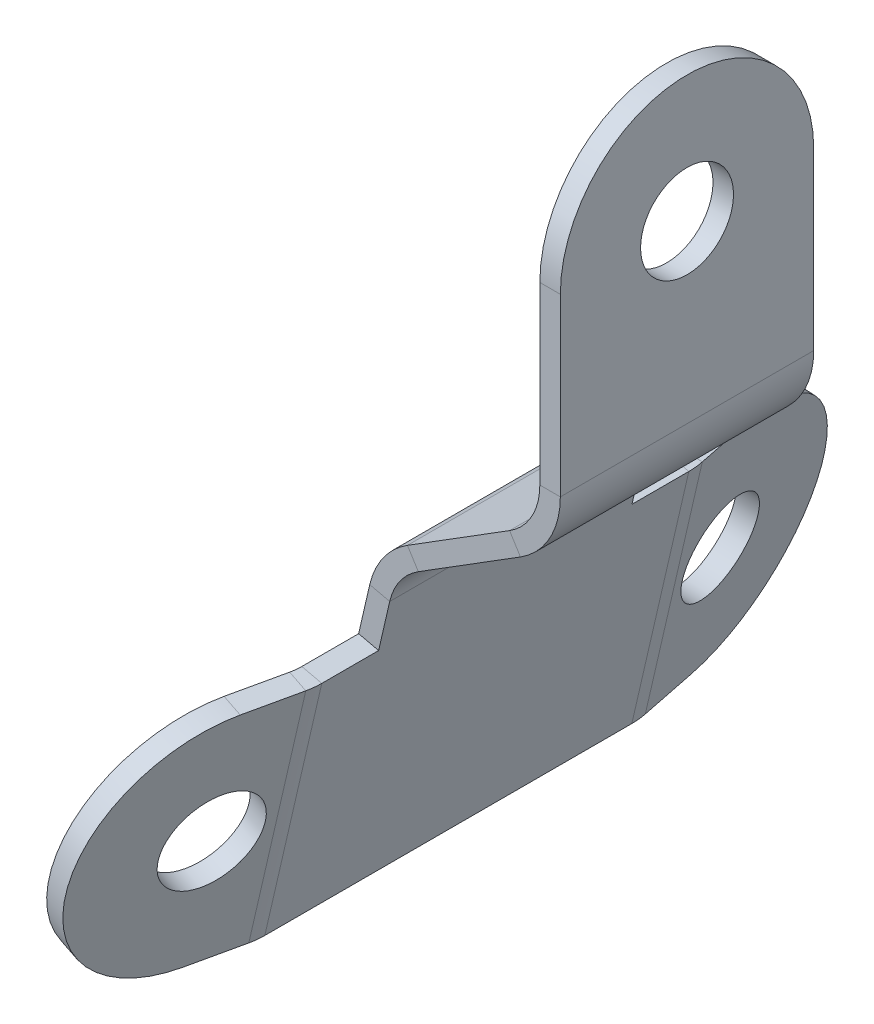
ISO-10303-21;
HEADER;
FILE_DESCRIPTION(('STEP AP214'),'2;1');
FILE_NAME('part.step','',(''),(''),'','','');
FILE_SCHEMA(('AUTOMOTIVE_DESIGN { 1 0 10303 214 1 1 1 1 }'));
ENDSEC;
DATA;
#1=APPLICATION_CONTEXT('core data for automotive mechanical design processes');
#2=APPLICATION_PROTOCOL_DEFINITION('international standard','automotive_design',2000,#1);
#3=PRODUCT_CONTEXT('',#1,'mechanical');
#4=PRODUCT('Part','Part','',(#3));
#5=PRODUCT_RELATED_PRODUCT_CATEGORY('part','',(#4));
#6=PRODUCT_DEFINITION_FORMATION('','',#4);
#7=PRODUCT_DEFINITION_CONTEXT('part definition',#1,'design');
#8=PRODUCT_DEFINITION('design','',#6,#7);
#9=PRODUCT_DEFINITION_SHAPE('','',#8);
#10=(LENGTH_UNIT() NAMED_UNIT(*) SI_UNIT(.MILLI.,.METRE.));
#11=(NAMED_UNIT(*) PLANE_ANGLE_UNIT() SI_UNIT($,.RADIAN.));
#12=(NAMED_UNIT(*) SI_UNIT($,.STERADIAN.) SOLID_ANGLE_UNIT());
#13=UNCERTAINTY_MEASURE_WITH_UNIT(LENGTH_MEASURE(1.E-05),#10,'distance_accuracy_value','');
#14=(GEOMETRIC_REPRESENTATION_CONTEXT(3) GLOBAL_UNCERTAINTY_ASSIGNED_CONTEXT((#13)) GLOBAL_UNIT_ASSIGNED_CONTEXT((#10,
#11,#12)) REPRESENTATION_CONTEXT('',''));
#15=CARTESIAN_POINT('',(0.,0.,0.));
#16=DIRECTION('',(0.,0.,1.));
#17=DIRECTION('',(1.,0.,0.));
#18=AXIS2_PLACEMENT_3D('',#15,#16,#17);
#19=CARTESIAN_POINT('',(-12.9180260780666,-45.7605188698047,7.5));
#20=DIRECTION('',(-0.974370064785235,0.224951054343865,0.));
#21=DIRECTION('',(-0.224951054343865,-0.974370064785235,0.));
#22=AXIS2_PLACEMENT_3D('',#19,#20,#21);
#23=PLANE('',#22);
#24=DIRECTION('',(0.,0.,-1.));
#25=VECTOR('',#24,1.);
#26=CARTESIAN_POINT('',(-12.9180260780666,-45.7605188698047,7.5));
#27=LINE('',#26,#25);
#28=CARTESIAN_POINT('',(-12.9180260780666,-45.7605188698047,10.8645387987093));
#29=VERTEX_POINT('',#28);
#30=CARTESIAN_POINT('',(-12.9180260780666,-45.7605188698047,-10.8645387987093));
#31=VERTEX_POINT('',#30);
#32=EDGE_CURVE('E70',#29,#31,#27,.T.);
#33=ORIENTED_EDGE('',*,*,#32,.T.);
#34=DIRECTION('',(0.224951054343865,0.974370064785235,0.));
#35=VECTOR('',#34,1.);
#36=CARTESIAN_POINT('',(-12.9180260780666,-45.7605188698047,-10.8645387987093));
#37=LINE('',#36,#35);
#38=CARTESIAN_POINT('',(-9.54376026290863,-31.1449678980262,-10.8645387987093));
#39=VERTEX_POINT('',#38);
#40=EDGE_CURVE('E62',#31,#39,#37,.T.);
#41=ORIENTED_EDGE('',*,*,#40,.T.);
#42=DIRECTION('',(0.,0.,-1.));
#43=VECTOR('',#42,1.);
#44=CARTESIAN_POINT('',(-9.54376026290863,-31.1449678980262,-22.5));
#45=LINE('',#44,#43);
#46=CARTESIAN_POINT('',(-9.54376026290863,-31.1449678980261,-7.5));
#47=VERTEX_POINT('',#46);
#48=EDGE_CURVE('E78',#47,#39,#45,.T.);
#49=ORIENTED_EDGE('',*,*,#48,.F.);
#50=DIRECTION('',(0.224951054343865,0.974370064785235,0.));
#51=VECTOR('',#50,1.);
#52=CARTESIAN_POINT('',(-12.9180260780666,-45.7605188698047,-7.5));
#53=LINE('',#52,#51);
#54=CARTESIAN_POINT('',(-8.8871413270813,-28.3008388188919,-7.5));
#55=VERTEX_POINT('',#54);
#56=EDGE_CURVE('E440',#47,#55,#53,.T.);
#57=ORIENTED_EDGE('',*,*,#56,.T.);
#58=DIRECTION('',(0.,0.,-1.));
#59=VECTOR('',#58,1.);
#60=CARTESIAN_POINT('',(-8.8871413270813,-28.3008388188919,7.5));
#61=LINE('',#60,#59);
#62=CARTESIAN_POINT('',(-8.8871413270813,-28.3008388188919,7.5));
#63=VERTEX_POINT('',#62);
#64=EDGE_CURVE('E465',#63,#55,#61,.T.);
#65=ORIENTED_EDGE('',*,*,#64,.F.);
#66=DIRECTION('',(0.224951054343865,0.974370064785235,0.));
#67=VECTOR('',#66,1.);
#68=CARTESIAN_POINT('',(-12.9180260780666,-45.7605188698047,7.5));
#69=LINE('',#68,#67);
#70=CARTESIAN_POINT('',(-9.54376026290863,-31.1449678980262,7.49999999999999));
#71=VERTEX_POINT('',#70);
#72=EDGE_CURVE('E402',#71,#63,#69,.T.);
#73=ORIENTED_EDGE('',*,*,#72,.F.);
#74=CARTESIAN_POINT('',(-9.54376026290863,-31.1449678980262,10.8645387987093));
#75=VERTEX_POINT('',#74);
#76=EDGE_CURVE('E377',#75,#71,#45,.T.);
#77=ORIENTED_EDGE('',*,*,#76,.F.);
#78=DIRECTION('',(0.224951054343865,0.974370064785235,0.));
#79=VECTOR('',#78,1.);
#80=CARTESIAN_POINT('',(-12.9180260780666,-45.7605188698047,10.8645387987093));
#81=LINE('',#80,#79);
#82=EDGE_CURVE('E538',#29,#75,#81,.T.);
#83=ORIENTED_EDGE('',*,*,#82,.F.);
#84=EDGE_LOOP('',(#33,#41,#49,#57,#65,#73,#77,#83));
#85=FACE_BOUND('',#84,.T.);
#86=ADVANCED_FACE('F52',(#85),#23,.F.);
#87=CARTESIAN_POINT('',(-14.1010282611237,-45.4874012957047,7.5));
#88=DIRECTION('',(-0.974370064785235,0.224951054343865,0.));
#89=DIRECTION('',(-0.224951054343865,-0.974370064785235,0.));
#90=AXIS2_PLACEMENT_3D('',#87,#88,#89);
#91=PLANE('',#90);
#92=DIRECTION('',(0.224951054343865,0.974370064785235,0.));
#93=VECTOR('',#92,1.);
#94=CARTESIAN_POINT('',(-14.1010282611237,-45.4874012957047,-10.8645387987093));
#95=LINE('',#94,#93);
#96=CARTESIAN_POINT('',(-14.1010282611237,-45.4874012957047,-10.8645387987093));
#97=VERTEX_POINT('',#96);
#98=CARTESIAN_POINT('',(-10.7267624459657,-30.8718503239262,-10.8645387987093));
#99=VERTEX_POINT('',#98);
#100=EDGE_CURVE('E546',#97,#99,#95,.T.);
#101=ORIENTED_EDGE('',*,*,#100,.F.);
#102=DIRECTION('',(0.,0.,-1.));
#103=VECTOR('',#102,1.);
#104=CARTESIAN_POINT('',(-14.1010282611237,-45.4874012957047,7.5));
#105=LINE('',#104,#103);
#106=CARTESIAN_POINT('',(-14.1010282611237,-45.4874012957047,10.8645387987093));
#107=VERTEX_POINT('',#106);
#108=EDGE_CURVE('E474',#107,#97,#105,.T.);
#109=ORIENTED_EDGE('',*,*,#108,.F.);
#110=DIRECTION('',(0.224951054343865,0.974370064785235,0.));
#111=VECTOR('',#110,1.);
#112=CARTESIAN_POINT('',(-14.1010282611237,-45.4874012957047,10.8645387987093));
#113=LINE('',#112,#111);
#114=CARTESIAN_POINT('',(-10.7267624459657,-30.8718503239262,10.8645387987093));
#115=VERTEX_POINT('',#114);
#116=EDGE_CURVE('E530',#107,#115,#113,.T.);
#117=ORIENTED_EDGE('',*,*,#116,.T.);
#118=DIRECTION('',(0.,0.,-1.));
#119=VECTOR('',#118,1.);
#120=CARTESIAN_POINT('',(-10.7267624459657,-30.8718503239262,-22.5));
#121=LINE('',#120,#119);
#122=CARTESIAN_POINT('',(-10.7267624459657,-30.8718503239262,7.5));
#123=VERTEX_POINT('',#122);
#124=EDGE_CURVE('E560',#115,#123,#121,.T.);
#125=ORIENTED_EDGE('',*,*,#124,.T.);
#126=DIRECTION('',(0.224951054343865,0.974370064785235,0.));
#127=VECTOR('',#126,1.);
#128=CARTESIAN_POINT('',(-14.1010282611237,-45.4874012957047,7.5));
#129=LINE('',#128,#127);
#130=CARTESIAN_POINT('',(-10.0701435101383,-28.027721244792,7.5));
#131=VERTEX_POINT('',#130);
#132=EDGE_CURVE('E399',#123,#131,#129,.T.);
#133=ORIENTED_EDGE('',*,*,#132,.T.);
#134=DIRECTION('',(0.,0.,-1.));
#135=VECTOR('',#134,1.);
#136=CARTESIAN_POINT('',(-10.0701435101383,-28.027721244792,7.5));
#137=LINE('',#136,#135);
#138=CARTESIAN_POINT('',(-10.0701435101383,-28.027721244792,-7.5));
#139=VERTEX_POINT('',#138);
#140=EDGE_CURVE('E469',#131,#139,#137,.T.);
#141=ORIENTED_EDGE('',*,*,#140,.T.);
#142=DIRECTION('',(0.224951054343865,0.974370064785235,0.));
#143=VECTOR('',#142,1.);
#144=CARTESIAN_POINT('',(-14.1010282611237,-45.4874012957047,-7.5));
#145=LINE('',#144,#143);
#146=CARTESIAN_POINT('',(-10.7267624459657,-30.8718503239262,-7.5));
#147=VERTEX_POINT('',#146);
#148=EDGE_CURVE('E437',#147,#139,#145,.T.);
#149=ORIENTED_EDGE('',*,*,#148,.F.);
#150=EDGE_CURVE('E56',#147,#99,#121,.T.);
#151=ORIENTED_EDGE('',*,*,#150,.T.);
#152=EDGE_LOOP('',(#101,#109,#117,#125,#133,#141,#149,#151));
#153=FACE_BOUND('',#152,.T.);
#154=ADVANCED_FACE('F572',(#153),#91,.T.);
#155=CARTESIAN_POINT('',(-12.9180260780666,-45.7605188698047,7.5));
#156=DIRECTION('',(-0.224951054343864,-0.974370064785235,0.));
#157=DIRECTION('',(0.974370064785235,-0.224951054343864,0.));
#158=AXIS2_PLACEMENT_3D('',#155,#156,#157);
#159=PLANE('',#158);
#160=DIRECTION('',(-0.974370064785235,0.224951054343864,0.));
#161=VECTOR('',#160,1.);
#162=CARTESIAN_POINT('',(-12.9180260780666,-45.7605188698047,-10.8645387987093));
#163=LINE('',#162,#161);
#164=EDGE_CURVE('E12',#31,#97,#163,.T.);
#165=ORIENTED_EDGE('',*,*,#164,.F.);
#166=ORIENTED_EDGE('',*,*,#32,.F.);
#167=DIRECTION('',(-0.974370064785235,0.224951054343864,0.));
#168=VECTOR('',#167,1.);
#169=CARTESIAN_POINT('',(-12.9180260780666,-45.7605188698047,10.8645387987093));
#170=LINE('',#169,#168);
#171=EDGE_CURVE('E534',#29,#107,#170,.T.);
#172=ORIENTED_EDGE('',*,*,#171,.T.);
#173=ORIENTED_EDGE('',*,*,#108,.T.);
#174=EDGE_LOOP('',(#165,#166,#172,#173));
#175=FACE_BOUND('',#174,.T.);
#176=ADVANCED_FACE('F54',(#175),#159,.T.);
#177=CARTESIAN_POINT('',(-9.54376026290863,-31.1449678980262,-22.5));
#178=DIRECTION('',(0.224951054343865,0.974370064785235,0.));
#179=DIRECTION('',(-0.974370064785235,0.224951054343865,0.));
#180=AXIS2_PLACEMENT_3D('',#177,#178,#179);
#181=PLANE('',#180);
#182=ORIENTED_EDGE('',*,*,#124,.F.);
#183=DIRECTION('',(0.974370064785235,-0.224951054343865,0.));
#184=VECTOR('',#183,1.);
#185=CARTESIAN_POINT('',(-9.54376026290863,-31.1449678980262,10.8645387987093));
#186=LINE('',#185,#184);
#187=EDGE_CURVE('E542',#115,#75,#186,.T.);
#188=ORIENTED_EDGE('',*,*,#187,.T.);
#189=ORIENTED_EDGE('',*,*,#76,.T.);
#190=DIRECTION('',(0.974370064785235,-0.224951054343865,0.));
#191=VECTOR('',#190,1.);
#192=CARTESIAN_POINT('',(-7.00586336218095,-31.7308875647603,7.5));
#193=LINE('',#192,#191);
#194=EDGE_CURVE('E512',#123,#71,#193,.T.);
#195=ORIENTED_EDGE('',*,*,#194,.F.);
#196=EDGE_LOOP('',(#182,#188,#189,#195));
#197=FACE_BOUND('',#196,.T.);
#198=ADVANCED_FACE('F653',(#197),#181,.T.);
#199=CARTESIAN_POINT('',(1.21412,-7.50000000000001,0.));
#200=DIRECTION('',(1.,0.,0.));
#201=DIRECTION('',(0.,1.,0.));
#202=AXIS2_PLACEMENT_3D('',#199,#200,#201);
#203=CYLINDRICAL_SURFACE('',#202,7.5);
#204=DIRECTION('',(1.,0.,0.));
#205=VECTOR('',#204,1.);
#206=CARTESIAN_POINT('',(-1.14762202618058,-7.49999999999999,7.5));
#207=LINE('',#206,#205);
#208=CARTESIAN_POINT('',(1.21412,-7.50000000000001,7.5));
#209=VERTEX_POINT('',#208);
#210=CARTESIAN_POINT('',(0.,-7.5,7.5));
#211=VERTEX_POINT('',#210);
#212=EDGE_CURVE('E516',#209,#211,#207,.F.);
#213=ORIENTED_EDGE('',*,*,#212,.F.);
#214=CARTESIAN_POINT('',(1.21412,-7.50000000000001,0.));
#215=DIRECTION('',(-1.,0.,0.));
#216=DIRECTION('',(0.,0.,1.));
#217=AXIS2_PLACEMENT_3D('',#214,#215,#216);
#218=CIRCLE('',#217,7.5);
#219=CARTESIAN_POINT('',(1.21412,-7.50000000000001,-7.5));
#220=VERTEX_POINT('',#219);
#221=EDGE_CURVE('E524',#220,#209,#218,.F.);
#222=ORIENTED_EDGE('',*,*,#221,.F.);
#223=DIRECTION('',(1.,0.,0.));
#224=VECTOR('',#223,1.);
#225=CARTESIAN_POINT('',(-3.80999999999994,-7.49999999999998,-7.5));
#226=LINE('',#225,#224);
#227=CARTESIAN_POINT('',(0.,-7.5,-7.5));
#228=VERTEX_POINT('',#227);
#229=EDGE_CURVE('E520',#228,#220,#226,.T.);
#230=ORIENTED_EDGE('',*,*,#229,.F.);
#231=CARTESIAN_POINT('',(0.,-7.5,0.));
#232=DIRECTION('',(-1.,0.,0.));
#233=DIRECTION('',(0.,0.,1.));
#234=AXIS2_PLACEMENT_3D('',#231,#232,#233);
#235=CIRCLE('',#234,7.5);
#236=EDGE_CURVE('E527',#211,#228,#235,.T.);
#237=ORIENTED_EDGE('',*,*,#236,.F.);
#238=EDGE_LOOP('',(#213,#222,#230,#237));
#239=FACE_BOUND('',#238,.T.);
#240=ADVANCED_FACE('F705',(#239),#203,.T.);
#241=CARTESIAN_POINT('',(-7.83716935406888,-24.8972069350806,7.5));
#242=DIRECTION('',(0.,0.,1.));
#243=DIRECTION('',(1.,0.,0.));
#244=AXIS2_PLACEMENT_3D('',#241,#242,#243);
#245=PLANE('',#244);
#246=DIRECTION('',(0.529919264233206,-0.848048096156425,0.));
#247=VECTOR('',#246,1.);
#248=CARTESIAN_POINT('',(-7.83716935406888,-24.8972069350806,7.5));
#249=LINE('',#248,#247);
#250=CARTESIAN_POINT('',(-7.83716935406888,-24.8972069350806,7.5));
#251=VERTEX_POINT('',#250);
#252=CARTESIAN_POINT('',(-7.19378377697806,-25.9268390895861,7.5));
#253=VERTEX_POINT('',#252);
#254=EDGE_CURVE('E509',#251,#253,#249,.T.);
#255=ORIENTED_EDGE('',*,*,#254,.F.);
#256=CARTESIAN_POINT('',(-5.17479138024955,-29.1579023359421,7.5));
#257=DIRECTION('',(0.,0.,1.));
#258=DIRECTION('',(1.,0.,0.));
#259=AXIS2_PLACEMENT_3D('',#256,#257,#258);
#260=CIRCLE('',#259,5.02412);
#261=EDGE_CURVE('E395',#131,#251,#260,.F.);
#262=ORIENTED_EDGE('',*,*,#261,.F.);
#263=DIRECTION('',(-0.974370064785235,0.224951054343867,0.));
#264=VECTOR('',#263,1.);
#265=CARTESIAN_POINT('',(-8.8871413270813,-28.3008388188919,7.5));
#266=LINE('',#265,#264);
#267=EDGE_CURVE('E505',#63,#131,#266,.T.);
#268=ORIENTED_EDGE('',*,*,#267,.F.);
#269=CARTESIAN_POINT('',(-5.17479138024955,-29.1579023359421,7.5));
#270=DIRECTION('',(0.,0.,1.));
#271=DIRECTION('',(1.,0.,0.));
#272=AXIS2_PLACEMENT_3D('',#269,#270,#271);
#273=CIRCLE('',#272,3.81);
#274=EDGE_CURVE('E405',#63,#253,#273,.F.);
#275=ORIENTED_EDGE('',*,*,#274,.T.);
#276=EDGE_LOOP('',(#255,#262,#268,#275));
#277=FACE_BOUND('',#276,.T.);
#278=ADVANCED_FACE('F647',(#277),#245,.T.);
#279=CARTESIAN_POINT('',(-8.8871413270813,-28.3008388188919,7.5));
#280=DIRECTION('',(0.,0.,1.));
#281=DIRECTION('',(1.,0.,0.));
#282=AXIS2_PLACEMENT_3D('',#279,#280,#281);
#283=PLANE('',#282);
#284=DIRECTION('',(0.848048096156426,0.529919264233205,0.));
#285=VECTOR('',#284,1.);
#286=CARTESIAN_POINT('',(-9.60200717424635,-26.,7.5));
#287=LINE('',#286,#285);
#288=CARTESIAN_POINT('',(-1.79100760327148,-21.1191457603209,7.5));
#289=VERTEX_POINT('',#288);
#290=EDGE_CURVE('E391',#251,#289,#287,.T.);
#291=ORIENTED_EDGE('',*,*,#290,.F.);
#292=ORIENTED_EDGE('',*,*,#254,.T.);
#293=DIRECTION('',(0.848048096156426,0.529919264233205,0.));
#294=VECTOR('',#293,1.);
#295=CARTESIAN_POINT('',(-8.95862159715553,-27.0296321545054,7.5));
#296=LINE('',#295,#294);
#297=CARTESIAN_POINT('',(-1.14762202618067,-22.1487779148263,7.5));
#298=VERTEX_POINT('',#297);
#299=EDGE_CURVE('E409',#253,#298,#296,.T.);
#300=ORIENTED_EDGE('',*,*,#299,.T.);
#301=DIRECTION('',(-0.529919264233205,0.848048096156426,0.));
#302=VECTOR('',#301,1.);
#303=CARTESIAN_POINT('',(-1.14762202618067,-22.1487779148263,7.5));
#304=LINE('',#303,#302);
#305=EDGE_CURVE('E492',#298,#289,#304,.T.);
#306=ORIENTED_EDGE('',*,*,#305,.T.);
#307=EDGE_LOOP('',(#291,#292,#300,#306));
#308=FACE_BOUND('',#307,.T.);
#309=ADVANCED_FACE('F644',(#308),#283,.T.);
#310=CARTESIAN_POINT('',(-10.0701435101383,-28.027721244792,-7.5));
#311=DIRECTION('',(0.,0.,-1.));
#312=DIRECTION('',(-1.,0.,0.));
#313=AXIS2_PLACEMENT_3D('',#310,#311,#312);
#314=PLANE('',#313);
#315=DIRECTION('',(0.974370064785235,-0.224951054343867,0.));
#316=VECTOR('',#315,1.);
#317=CARTESIAN_POINT('',(-10.0701435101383,-28.027721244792,-7.5));
#318=LINE('',#317,#316);
#319=EDGE_CURVE('E501',#139,#55,#318,.T.);
#320=ORIENTED_EDGE('',*,*,#319,.F.);
#321=CARTESIAN_POINT('',(-5.17479138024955,-29.1579023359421,-7.5));
#322=DIRECTION('',(0.,0.,1.));
#323=DIRECTION('',(1.,0.,0.));
#324=AXIS2_PLACEMENT_3D('',#321,#322,#323);
#325=CIRCLE('',#324,5.02412);
#326=CARTESIAN_POINT('',(-7.83716935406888,-24.8972069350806,-7.5));
#327=VERTEX_POINT('',#326);
#328=EDGE_CURVE('E433',#139,#327,#325,.F.);
#329=ORIENTED_EDGE('',*,*,#328,.T.);
#330=DIRECTION('',(-0.529919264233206,0.848048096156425,0.));
#331=VECTOR('',#330,1.);
#332=CARTESIAN_POINT('',(-7.19378377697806,-25.9268390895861,-7.5));
#333=LINE('',#332,#331);
#334=CARTESIAN_POINT('',(-7.19378377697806,-25.9268390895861,-7.5));
#335=VERTEX_POINT('',#334);
#336=EDGE_CURVE('E498',#335,#327,#333,.T.);
#337=ORIENTED_EDGE('',*,*,#336,.F.);
#338=CARTESIAN_POINT('',(-5.17479138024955,-29.1579023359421,-7.5));
#339=DIRECTION('',(0.,0.,1.));
#340=DIRECTION('',(1.,0.,0.));
#341=AXIS2_PLACEMENT_3D('',#338,#339,#340);
#342=CIRCLE('',#341,3.81);
#343=EDGE_CURVE('E443',#55,#335,#342,.F.);
#344=ORIENTED_EDGE('',*,*,#343,.F.);
#345=EDGE_LOOP('',(#320,#329,#337,#344));
#346=FACE_BOUND('',#345,.T.);
#347=ADVANCED_FACE('F608',(#346),#314,.T.);
#348=CARTESIAN_POINT('',(-7.19378377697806,-25.9268390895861,-7.5));
#349=DIRECTION('',(0.,0.,-1.));
#350=DIRECTION('',(-1.,0.,0.));
#351=AXIS2_PLACEMENT_3D('',#348,#349,#350);
#352=PLANE('',#351);
#353=DIRECTION('',(0.974370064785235,-0.224951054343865,0.));
#354=VECTOR('',#353,1.);
#355=CARTESIAN_POINT('',(-8.45643813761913,-31.3959959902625,-7.5));
#356=LINE('',#355,#354);
#357=EDGE_CURVE('E373',#147,#47,#356,.T.);
#358=ORIENTED_EDGE('',*,*,#357,.F.);
#359=ORIENTED_EDGE('',*,*,#148,.T.);
#360=ORIENTED_EDGE('',*,*,#319,.T.);
#361=ORIENTED_EDGE('',*,*,#56,.F.);
#362=EDGE_LOOP('',(#358,#359,#360,#361));
#363=FACE_BOUND('',#362,.T.);
#364=ADVANCED_FACE('F602',(#363),#352,.T.);
#365=CARTESIAN_POINT('',(0.,-17.8880825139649,7.5));
#366=DIRECTION('',(0.,0.,1.));
#367=DIRECTION('',(1.,0.,0.));
#368=AXIS2_PLACEMENT_3D('',#365,#366,#367);
#369=PLANE('',#368);
#370=DIRECTION('',(1.,0.,0.));
#371=VECTOR('',#370,1.);
#372=CARTESIAN_POINT('',(0.,-17.8880825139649,7.5));
#373=LINE('',#372,#371);
#374=CARTESIAN_POINT('',(0.,-17.8880825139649,7.5));
#375=VERTEX_POINT('',#374);
#376=CARTESIAN_POINT('',(1.21412,-17.8880825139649,7.5));
#377=VERTEX_POINT('',#376);
#378=EDGE_CURVE('E495',#375,#377,#373,.T.);
#379=ORIENTED_EDGE('',*,*,#378,.F.);
#380=CARTESIAN_POINT('',(-3.81,-17.8880825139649,7.5));
#381=DIRECTION('',(0.,0.,-1.));
#382=DIRECTION('',(-1.,0.,0.));
#383=AXIS2_PLACEMENT_3D('',#380,#381,#382);
#384=CIRCLE('',#383,3.81);
#385=EDGE_CURVE('E387',#289,#375,#384,.F.);
#386=ORIENTED_EDGE('',*,*,#385,.F.);
#387=ORIENTED_EDGE('',*,*,#305,.F.);
#388=CARTESIAN_POINT('',(-3.81,-17.8880825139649,7.5));
#389=DIRECTION('',(0.,0.,1.));
#390=DIRECTION('',(1.,0.,0.));
#391=AXIS2_PLACEMENT_3D('',#388,#389,#390);
#392=CIRCLE('',#391,5.02412);
#393=EDGE_CURVE('E413',#298,#377,#392,.T.);
#394=ORIENTED_EDGE('',*,*,#393,.T.);
#395=EDGE_LOOP('',(#379,#386,#387,#394));
#396=FACE_BOUND('',#395,.T.);
#397=ADVANCED_FACE('F642',(#396),#369,.T.);
#398=CARTESIAN_POINT('',(-1.14762202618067,-22.1487779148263,7.5));
#399=DIRECTION('',(0.,0.,1.));
#400=DIRECTION('',(1.,0.,0.));
#401=AXIS2_PLACEMENT_3D('',#398,#399,#400);
#402=PLANE('',#401);
#403=DIRECTION('',(0.,1.,0.));
#404=VECTOR('',#403,1.);
#405=CARTESIAN_POINT('',(1.21412,-20.,7.5));
#406=LINE('',#405,#404);
#407=EDGE_CURVE('E378',#377,#209,#406,.T.);
#408=ORIENTED_EDGE('',*,*,#407,.T.);
#409=ORIENTED_EDGE('',*,*,#212,.T.);
#410=DIRECTION('',(0.,1.,0.));
#411=VECTOR('',#410,1.);
#412=CARTESIAN_POINT('',(0.,-20.,7.5));
#413=LINE('',#412,#411);
#414=EDGE_CURVE('E382',#375,#211,#413,.T.);
#415=ORIENTED_EDGE('',*,*,#414,.F.);
#416=ORIENTED_EDGE('',*,*,#378,.T.);
#417=EDGE_LOOP('',(#408,#409,#415,#416));
#418=FACE_BOUND('',#417,.T.);
#419=ADVANCED_FACE('F722',(#418),#402,.T.);
#420=CARTESIAN_POINT('',(-1.79100760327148,-21.1191457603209,-7.5));
#421=DIRECTION('',(0.,0.,-1.));
#422=DIRECTION('',(-1.,0.,0.));
#423=AXIS2_PLACEMENT_3D('',#420,#421,#422);
#424=PLANE('',#423);
#425=DIRECTION('',(0.529919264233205,-0.848048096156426,0.));
#426=VECTOR('',#425,1.);
#427=CARTESIAN_POINT('',(-1.79100760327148,-21.1191457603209,-7.5));
#428=LINE('',#427,#426);
#429=CARTESIAN_POINT('',(-1.79100760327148,-21.1191457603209,-7.5));
#430=VERTEX_POINT('',#429);
#431=CARTESIAN_POINT('',(-1.14762202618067,-22.1487779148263,-7.5));
#432=VERTEX_POINT('',#431);
#433=EDGE_CURVE('E489',#430,#432,#428,.T.);
#434=ORIENTED_EDGE('',*,*,#433,.F.);
#435=CARTESIAN_POINT('',(-3.81,-17.8880825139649,-7.5));
#436=DIRECTION('',(0.,0.,-1.));
#437=DIRECTION('',(-1.,0.,0.));
#438=AXIS2_PLACEMENT_3D('',#435,#436,#437);
#439=CIRCLE('',#438,3.81);
#440=CARTESIAN_POINT('',(0.,-17.8880825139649,-7.5));
#441=VERTEX_POINT('',#440);
#442=EDGE_CURVE('E425',#430,#441,#439,.F.);
#443=ORIENTED_EDGE('',*,*,#442,.T.);
#444=DIRECTION('',(-1.,0.,0.));
#445=VECTOR('',#444,1.);
#446=CARTESIAN_POINT('',(1.21412,-17.8880825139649,-7.5));
#447=LINE('',#446,#445);
#448=CARTESIAN_POINT('',(1.21412,-17.8880825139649,-7.5));
#449=VERTEX_POINT('',#448);
#450=EDGE_CURVE('E486',#449,#441,#447,.T.);
#451=ORIENTED_EDGE('',*,*,#450,.F.);
#452=CARTESIAN_POINT('',(-3.81,-17.8880825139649,-7.5));
#453=DIRECTION('',(0.,0.,1.));
#454=DIRECTION('',(1.,0.,0.));
#455=AXIS2_PLACEMENT_3D('',#452,#453,#454);
#456=CIRCLE('',#455,5.02412);
#457=EDGE_CURVE('E383',#432,#449,#456,.T.);
#458=ORIENTED_EDGE('',*,*,#457,.F.);
#459=EDGE_LOOP('',(#434,#443,#451,#458));
#460=FACE_BOUND('',#459,.T.);
#461=ADVANCED_FACE('F630',(#460),#424,.T.);
#462=CARTESIAN_POINT('',(1.21412,-17.8880825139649,-7.5));
#463=DIRECTION('',(0.,0.,-1.));
#464=DIRECTION('',(-1.,0.,0.));
#465=AXIS2_PLACEMENT_3D('',#462,#463,#464);
#466=PLANE('',#465);
#467=DIRECTION('',(0.848048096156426,0.529919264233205,0.));
#468=VECTOR('',#467,1.);
#469=CARTESIAN_POINT('',(-9.60200717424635,-26.,-7.5));
#470=LINE('',#469,#468);
#471=EDGE_CURVE('E429',#327,#430,#470,.T.);
#472=ORIENTED_EDGE('',*,*,#471,.T.);
#473=ORIENTED_EDGE('',*,*,#433,.T.);
#474=DIRECTION('',(0.848048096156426,0.529919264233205,0.));
#475=VECTOR('',#474,1.);
#476=CARTESIAN_POINT('',(-8.95862159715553,-27.0296321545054,-7.5));
#477=LINE('',#476,#475);
#478=EDGE_CURVE('E447',#335,#432,#477,.T.);
#479=ORIENTED_EDGE('',*,*,#478,.F.);
#480=ORIENTED_EDGE('',*,*,#336,.T.);
#481=EDGE_LOOP('',(#472,#473,#479,#480));
#482=FACE_BOUND('',#481,.T.);
#483=ADVANCED_FACE('F612',(#482),#466,.T.);
#484=CARTESIAN_POINT('',(1.21412,-20.,7.5));
#485=DIRECTION('',(-1.,0.,0.));
#486=DIRECTION('',(0.,0.,1.));
#487=AXIS2_PLACEMENT_3D('',#484,#485,#486);
#488=PLANE('',#487);
#489=CARTESIAN_POINT('',(1.21412,-7.5,0.));
#490=DIRECTION('',(-1.,0.,0.));
#491=DIRECTION('',(0.,0.,1.));
#492=AXIS2_PLACEMENT_3D('',#489,#490,#491);
#493=CIRCLE('',#492,2.74999999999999);
#494=CARTESIAN_POINT('',(1.21412,-7.5,2.74999999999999));
#495=VERTEX_POINT('',#494);
#496=EDGE_CURVE('E369',#495,#495,#493,.T.);
#497=ORIENTED_EDGE('',*,*,#496,.T.);
#498=EDGE_LOOP('',(#497));
#499=FACE_BOUND('',#498,.T.);
#500=DIRECTION('',(0.,1.,0.));
#501=VECTOR('',#500,1.);
#502=CARTESIAN_POINT('',(1.21412,-20.,-7.5));
#503=LINE('',#502,#501);
#504=EDGE_CURVE('E376',#449,#220,#503,.T.);
#505=ORIENTED_EDGE('',*,*,#504,.T.);
#506=ORIENTED_EDGE('',*,*,#221,.T.);
#507=ORIENTED_EDGE('',*,*,#407,.F.);
#508=DIRECTION('',(0.,0.,-1.));
#509=VECTOR('',#508,1.);
#510=CARTESIAN_POINT('',(1.21412,-17.8880825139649,7.5));
#511=LINE('',#510,#509);
#512=EDGE_CURVE('E417',#377,#449,#511,.T.);
#513=ORIENTED_EDGE('',*,*,#512,.T.);
#514=EDGE_LOOP('',(#505,#506,#507,#513));
#515=FACE_BOUND('',#514,.T.);
#516=ADVANCED_FACE('F730',(#499,#515),#488,.F.);
#517=CARTESIAN_POINT('',(0.,-20.,7.5));
#518=DIRECTION('',(-1.,0.,0.));
#519=DIRECTION('',(0.,0.,1.));
#520=AXIS2_PLACEMENT_3D('',#517,#518,#519);
#521=PLANE('',#520);
#522=CARTESIAN_POINT('',(0.,-7.5,0.));
#523=DIRECTION('',(-1.,0.,0.));
#524=DIRECTION('',(0.,0.,1.));
#525=AXIS2_PLACEMENT_3D('',#522,#523,#524);
#526=CIRCLE('',#525,2.74999999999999);
#527=CARTESIAN_POINT('',(0.,-7.5,2.74999999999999));
#528=VERTEX_POINT('',#527);
#529=EDGE_CURVE('E360',#528,#528,#526,.T.);
#530=ORIENTED_EDGE('',*,*,#529,.F.);
#531=EDGE_LOOP('',(#530));
#532=FACE_BOUND('',#531,.T.);
#533=ORIENTED_EDGE('',*,*,#414,.T.);
#534=ORIENTED_EDGE('',*,*,#236,.T.);
#535=DIRECTION('',(0.,1.,0.));
#536=VECTOR('',#535,1.);
#537=CARTESIAN_POINT('',(0.,-20.,-7.5));
#538=LINE('',#537,#536);
#539=EDGE_CURVE('E421',#441,#228,#538,.T.);
#540=ORIENTED_EDGE('',*,*,#539,.F.);
#541=DIRECTION('',(0.,0.,-1.));
#542=VECTOR('',#541,1.);
#543=CARTESIAN_POINT('',(0.,-17.8880825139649,7.5));
#544=LINE('',#543,#542);
#545=EDGE_CURVE('E482',#375,#441,#544,.T.);
#546=ORIENTED_EDGE('',*,*,#545,.F.);
#547=EDGE_LOOP('',(#533,#534,#540,#546));
#548=FACE_BOUND('',#547,.T.);
#549=ADVANCED_FACE('F733',(#532,#548),#521,.T.);
#550=CARTESIAN_POINT('',(-3.81,-17.8880825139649,7.5));
#551=DIRECTION('',(0.,0.,-1.));
#552=DIRECTION('',(-1.,0.,0.));
#553=AXIS2_PLACEMENT_3D('',#550,#551,#552);
#554=CYLINDRICAL_SURFACE('',#553,3.81);
#555=ORIENTED_EDGE('',*,*,#442,.F.);
#556=DIRECTION('',(0.,0.,-1.));
#557=VECTOR('',#556,1.);
#558=CARTESIAN_POINT('',(-1.79100760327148,-21.1191457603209,7.5));
#559=LINE('',#558,#557);
#560=EDGE_CURVE('E478',#289,#430,#559,.T.);
#561=ORIENTED_EDGE('',*,*,#560,.F.);
#562=ORIENTED_EDGE('',*,*,#385,.T.);
#563=ORIENTED_EDGE('',*,*,#545,.T.);
#564=EDGE_LOOP('',(#555,#561,#562,#563));
#565=FACE_BOUND('',#564,.T.);
#566=ADVANCED_FACE('F626',(#565),#554,.F.);
#567=CARTESIAN_POINT('',(-9.60200717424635,-26.,7.5));
#568=DIRECTION('',(-0.529919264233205,0.848048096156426,0.));
#569=DIRECTION('',(-0.848048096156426,-0.529919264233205,0.));
#570=AXIS2_PLACEMENT_3D('',#567,#568,#569);
#571=PLANE('',#570);
#572=ORIENTED_EDGE('',*,*,#471,.F.);
#573=DIRECTION('',(0.,0.,-1.));
#574=VECTOR('',#573,1.);
#575=CARTESIAN_POINT('',(-7.83716935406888,-24.8972069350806,7.5));
#576=LINE('',#575,#574);
#577=EDGE_CURVE('E473',#251,#327,#576,.T.);
#578=ORIENTED_EDGE('',*,*,#577,.F.);
#579=ORIENTED_EDGE('',*,*,#290,.T.);
#580=ORIENTED_EDGE('',*,*,#560,.T.);
#581=EDGE_LOOP('',(#572,#578,#579,#580));
#582=FACE_BOUND('',#581,.T.);
#583=ADVANCED_FACE('F621',(#582),#571,.T.);
#584=CARTESIAN_POINT('',(-5.17479138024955,-29.1579023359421,7.5));
#585=DIRECTION('',(0.,0.,-1.));
#586=DIRECTION('',(-1.,0.,0.));
#587=AXIS2_PLACEMENT_3D('',#584,#585,#586);
#588=CYLINDRICAL_SURFACE('',#587,5.02412);
#589=ORIENTED_EDGE('',*,*,#328,.F.);
#590=ORIENTED_EDGE('',*,*,#140,.F.);
#591=ORIENTED_EDGE('',*,*,#261,.T.);
#592=ORIENTED_EDGE('',*,*,#577,.T.);
#593=EDGE_LOOP('',(#589,#590,#591,#592));
#594=FACE_BOUND('',#593,.T.);
#595=ADVANCED_FACE('F616',(#594),#588,.T.);
#596=CARTESIAN_POINT('',(-5.17479138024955,-29.1579023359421,7.5));
#597=DIRECTION('',(0.,0.,-1.));
#598=DIRECTION('',(-1.,0.,0.));
#599=AXIS2_PLACEMENT_3D('',#596,#597,#598);
#600=CYLINDRICAL_SURFACE('',#599,3.81);
#601=ORIENTED_EDGE('',*,*,#343,.T.);
#602=DIRECTION('',(0.,0.,-1.));
#603=VECTOR('',#602,1.);
#604=CARTESIAN_POINT('',(-7.19378377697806,-25.9268390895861,7.5));
#605=LINE('',#604,#603);
#606=EDGE_CURVE('E461',#253,#335,#605,.T.);
#607=ORIENTED_EDGE('',*,*,#606,.F.);
#608=ORIENTED_EDGE('',*,*,#274,.F.);
#609=ORIENTED_EDGE('',*,*,#64,.T.);
#610=EDGE_LOOP('',(#601,#607,#608,#609));
#611=FACE_BOUND('',#610,.T.);
#612=ADVANCED_FACE('F606',(#611),#600,.F.);
#613=CARTESIAN_POINT('',(-8.95862159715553,-27.0296321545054,7.5));
#614=DIRECTION('',(-0.529919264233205,0.848048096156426,0.));
#615=DIRECTION('',(-0.848048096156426,-0.529919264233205,0.));
#616=AXIS2_PLACEMENT_3D('',#613,#614,#615);
#617=PLANE('',#616);
#618=ORIENTED_EDGE('',*,*,#478,.T.);
#619=DIRECTION('',(0.,0.,-1.));
#620=VECTOR('',#619,1.);
#621=CARTESIAN_POINT('',(-1.14762202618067,-22.1487779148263,7.5));
#622=LINE('',#621,#620);
#623=EDGE_CURVE('E457',#298,#432,#622,.T.);
#624=ORIENTED_EDGE('',*,*,#623,.F.);
#625=ORIENTED_EDGE('',*,*,#299,.F.);
#626=ORIENTED_EDGE('',*,*,#606,.T.);
#627=EDGE_LOOP('',(#618,#624,#625,#626));
#628=FACE_BOUND('',#627,.T.);
#629=ADVANCED_FACE('F634',(#628),#617,.F.);
#630=CARTESIAN_POINT('',(-3.81,-17.8880825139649,7.5));
#631=DIRECTION('',(0.,0.,-1.));
#632=DIRECTION('',(-1.,0.,0.));
#633=AXIS2_PLACEMENT_3D('',#630,#631,#632);
#634=CYLINDRICAL_SURFACE('',#633,5.02412);
#635=ORIENTED_EDGE('',*,*,#457,.T.);
#636=ORIENTED_EDGE('',*,*,#512,.F.);
#637=ORIENTED_EDGE('',*,*,#393,.F.);
#638=ORIENTED_EDGE('',*,*,#623,.T.);
#639=EDGE_LOOP('',(#635,#636,#637,#638));
#640=FACE_BOUND('',#639,.T.);
#641=ADVANCED_FACE('F638',(#640),#634,.T.);
#642=CARTESIAN_POINT('',(-3.81,-17.8880825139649,7.5));
#643=DIRECTION('',(0.,0.,-1.));
#644=DIRECTION('',(-1.,0.,0.));
#645=AXIS2_PLACEMENT_3D('',#642,#643,#644);
#646=PLANE('',#645);
#647=ORIENTED_EDGE('',*,*,#132,.F.);
#648=ORIENTED_EDGE('',*,*,#194,.T.);
#649=ORIENTED_EDGE('',*,*,#72,.T.);
#650=ORIENTED_EDGE('',*,*,#267,.T.);
#651=EDGE_LOOP('',(#647,#648,#649,#650));
#652=FACE_BOUND('',#651,.T.);
#653=ADVANCED_FACE('F650',(#652),#646,.F.);
#654=CARTESIAN_POINT('',(-3.81,-17.8880825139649,-7.5));
#655=DIRECTION('',(0.,0.,-1.));
#656=DIRECTION('',(-1.,0.,0.));
#657=AXIS2_PLACEMENT_3D('',#654,#655,#656);
#658=PLANE('',#657);
#659=ORIENTED_EDGE('',*,*,#539,.T.);
#660=ORIENTED_EDGE('',*,*,#229,.T.);
#661=ORIENTED_EDGE('',*,*,#504,.F.);
#662=ORIENTED_EDGE('',*,*,#450,.T.);
#663=EDGE_LOOP('',(#659,#660,#661,#662));
#664=FACE_BOUND('',#663,.T.);
#665=ADVANCED_FACE('F702',(#664),#658,.T.);
#666=DIRECTION('',(0.974370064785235,-0.224951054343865,0.));
#667=VECTOR('',#666,1.);
#668=CARTESIAN_POINT('',(-9.54376026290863,-31.1449678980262,-10.8645387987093));
#669=LINE('',#668,#667);
#670=EDGE_CURVE('E550',#99,#39,#669,.T.);
#671=ORIENTED_EDGE('',*,*,#670,.F.);
#672=ORIENTED_EDGE('',*,*,#150,.F.);
#673=ORIENTED_EDGE('',*,*,#357,.T.);
#674=ORIENTED_EDGE('',*,*,#48,.T.);
#675=EDGE_LOOP('',(#671,#672,#673,#674));
#676=FACE_BOUND('',#675,.T.);
#677=ADVANCED_FACE('F575',(#676),#181,.T.);
#678=CARTESIAN_POINT('',(0.,-7.5,0.));
#679=DIRECTION('',(-1.,0.,0.));
#680=DIRECTION('',(0.,0.,1.));
#681=AXIS2_PLACEMENT_3D('',#678,#679,#680);
#682=CYLINDRICAL_SURFACE('',#681,2.74999999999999);
#683=ORIENTED_EDGE('',*,*,#496,.F.);
#684=EDGE_LOOP('',(#683));
#685=FACE_BOUND('',#684,.T.);
#686=ORIENTED_EDGE('',*,*,#529,.T.);
#687=EDGE_LOOP('',(#686));
#688=FACE_BOUND('',#687,.T.);
#689=ADVANCED_FACE('F701',(#685,#688),#682,.F.);
#690=CARTESIAN_POINT('',(-17.8133782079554,-44.6303377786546,10.8645387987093));
#691=DIRECTION('',(0.224951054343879,0.974370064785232,0.));
#692=DIRECTION('',(-0.974370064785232,0.224951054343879,0.));
#693=AXIS2_PLACEMENT_3D('',#690,#691,#692);
#694=PLANE('',#693);
#695=ORIENTED_EDGE('',*,*,#171,.F.);
#696=CARTESIAN_POINT('',(-17.8133782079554,-44.6303377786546,10.8645387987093));
#697=DIRECTION('',(0.224951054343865,0.974370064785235,0.));
#698=DIRECTION('',(-0.974370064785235,0.224951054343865,0.));
#699=AXIS2_PLACEMENT_3D('',#696,#697,#698);
#700=CIRCLE('',#699,5.02412);
#701=CARTESIAN_POINT('',(-12.9923974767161,-45.743348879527,11.7369680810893));
#702=VERTEX_POINT('',#701);
#703=EDGE_CURVE('E302',#29,#702,#700,.F.);
#704=ORIENTED_EDGE('',*,*,#703,.T.);
#705=DIRECTION('',(-0.959567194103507,0.221533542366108,-0.173648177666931));
#706=VECTOR('',#705,1.);
#707=CARTESIAN_POINT('',(-12.9923974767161,-45.743348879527,11.7369680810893));
#708=LINE('',#707,#706);
#709=CARTESIAN_POINT('',(-14.157427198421,-45.4743805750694,11.5261383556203));
#710=VERTEX_POINT('',#709);
#711=EDGE_CURVE('E340',#702,#710,#708,.T.);
#712=ORIENTED_EDGE('',*,*,#711,.T.);
#713=CARTESIAN_POINT('',(-17.8133782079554,-44.6303377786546,10.8645387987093));
#714=DIRECTION('',(-0.224951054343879,-0.974370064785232,0.));
#715=DIRECTION('',(-0.974370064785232,0.224951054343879,0.));
#716=AXIS2_PLACEMENT_3D('',#713,#714,#715);
#717=CIRCLE('',#716,3.81);
#718=EDGE_CURVE('E351',#107,#710,#717,.T.);
#719=ORIENTED_EDGE('',*,*,#718,.F.);
#720=EDGE_LOOP('',(#695,#704,#712,#719));
#721=FACE_BOUND('',#720,.T.);
#722=ADVANCED_FACE('F663',(#721),#694,.F.);
#723=CARTESIAN_POINT('',(-14.4391123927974,-30.0147868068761,10.8645387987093));
#724=DIRECTION('',(-0.224951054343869,-0.974370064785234,0.));
#725=DIRECTION('',(0.974370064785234,-0.224951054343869,0.));
#726=AXIS2_PLACEMENT_3D('',#723,#724,#725);
#727=PLANE('',#726);
#728=CARTESIAN_POINT('',(-14.4391123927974,-30.0147868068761,10.8645387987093));
#729=DIRECTION('',(0.224951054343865,0.974370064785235,0.));
#730=DIRECTION('',(-0.974370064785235,0.224951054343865,0.));
#731=AXIS2_PLACEMENT_3D('',#728,#729,#730);
#732=CIRCLE('',#731,5.02412);
#733=CARTESIAN_POINT('',(-9.61813166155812,-31.1277979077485,11.7369680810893));
#734=VERTEX_POINT('',#733);
#735=EDGE_CURVE('E356',#734,#75,#732,.T.);
#736=ORIENTED_EDGE('',*,*,#735,.T.);
#737=ORIENTED_EDGE('',*,*,#187,.F.);
#738=CARTESIAN_POINT('',(-14.4391123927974,-30.0147868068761,10.8645387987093));
#739=DIRECTION('',(0.224951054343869,0.974370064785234,0.));
#740=DIRECTION('',(-0.974370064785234,0.224951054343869,0.));
#741=AXIS2_PLACEMENT_3D('',#738,#739,#740);
#742=CIRCLE('',#741,3.81);
#743=CARTESIAN_POINT('',(-10.7831613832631,-30.8588296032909,11.5261383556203));
#744=VERTEX_POINT('',#743);
#745=EDGE_CURVE('E355',#744,#115,#742,.T.);
#746=ORIENTED_EDGE('',*,*,#745,.F.);
#747=DIRECTION('',(0.959567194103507,-0.221533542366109,0.173648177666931));
#748=VECTOR('',#747,1.);
#749=CARTESIAN_POINT('',(-9.61813166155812,-31.1277979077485,11.7369680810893));
#750=LINE('',#749,#748);
#751=EDGE_CURVE('E344',#744,#734,#750,.T.);
#752=ORIENTED_EDGE('',*,*,#751,.T.);
#753=EDGE_LOOP('',(#736,#737,#746,#752));
#754=FACE_BOUND('',#753,.T.);
#755=ADVANCED_FACE('F656',(#754),#727,.F.);
#756=CARTESIAN_POINT('',(-19.6331410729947,-52.5125967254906,10.8645387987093));
#757=DIRECTION('',(0.224951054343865,0.974370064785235,0.));
#758=DIRECTION('',(-0.974370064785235,0.224951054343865,0.));
#759=AXIS2_PLACEMENT_3D('',#756,#757,#758);
#760=CYLINDRICAL_SURFACE('',#759,3.81);
#761=DIRECTION('',(0.224951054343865,0.974370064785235,0.));
#762=VECTOR('',#761,1.);
#763=CARTESIAN_POINT('',(-14.157427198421,-45.4743805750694,11.5261383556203));
#764=LINE('',#763,#762);
#765=EDGE_CURVE('E294',#710,#744,#764,.T.);
#766=ORIENTED_EDGE('',*,*,#765,.T.);
#767=ORIENTED_EDGE('',*,*,#745,.T.);
#768=ORIENTED_EDGE('',*,*,#116,.F.);
#769=ORIENTED_EDGE('',*,*,#718,.T.);
#770=EDGE_LOOP('',(#766,#767,#768,#769));
#771=FACE_BOUND('',#770,.T.);
#772=ADVANCED_FACE('F659',(#771),#760,.F.);
#773=CARTESIAN_POINT('',(-19.6331410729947,-52.5125967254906,10.8645387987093));
#774=DIRECTION('',(0.224951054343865,0.974370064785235,0.));
#775=DIRECTION('',(-0.974370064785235,0.224951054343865,0.));
#776=AXIS2_PLACEMENT_3D('',#773,#774,#775);
#777=CYLINDRICAL_SURFACE('',#776,5.02412);
#778=DIRECTION('',(0.224951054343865,0.974370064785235,0.));
#779=VECTOR('',#778,1.);
#780=CARTESIAN_POINT('',(-12.9923974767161,-45.743348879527,11.7369680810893));
#781=LINE('',#780,#779);
#782=EDGE_CURVE('E310',#702,#734,#781,.T.);
#783=ORIENTED_EDGE('',*,*,#782,.F.);
#784=ORIENTED_EDGE('',*,*,#703,.F.);
#785=ORIENTED_EDGE('',*,*,#82,.T.);
#786=ORIENTED_EDGE('',*,*,#735,.F.);
#787=EDGE_LOOP('',(#783,#784,#785,#786));
#788=FACE_BOUND('',#787,.T.);
#789=ADVANCED_FACE('F666',(#788),#777,.T.);
#790=CARTESIAN_POINT('',(-13.0395661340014,-38.0351783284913,14.8395622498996));
#791=DIRECTION('',(-0.959567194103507,0.221533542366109,-0.173648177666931));
#792=DIRECTION('',(-0.224951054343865,-0.974370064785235,0.));
#793=AXIS2_PLACEMENT_3D('',#790,#791,#792);
#794=CYLINDRICAL_SURFACE('',#793,2.75);
#795=CARTESIAN_POINT('',(-11.8745364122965,-38.3041466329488,15.0503919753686));
#796=DIRECTION('',(-0.959567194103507,0.221533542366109,-0.173648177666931));
#797=DIRECTION('',(-0.224951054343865,-0.974370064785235,0.));
#798=AXIS2_PLACEMENT_3D('',#795,#796,#797);
#799=CIRCLE('',#798,2.75);
#800=CARTESIAN_POINT('',(-12.4931518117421,-40.9836643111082,15.0503919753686));
#801=VERTEX_POINT('',#800);
#802=EDGE_CURVE('E317',#801,#801,#799,.T.);
#803=CARTESIAN_POINT('',(-13.0395661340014,-38.0351783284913,14.8395622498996));
#804=DIRECTION('',(-0.959567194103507,0.221533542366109,-0.173648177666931));
#805=DIRECTION('',(-0.224951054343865,-0.974370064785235,0.));
#806=AXIS2_PLACEMENT_3D('',#803,#804,#805);
#807=CIRCLE('',#806,2.74999999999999);
#808=CARTESIAN_POINT('',(-13.658181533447,-40.7146960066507,14.8395622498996));
#809=VERTEX_POINT('',#808);
#810=EDGE_CURVE('E336',#809,#809,#807,.T.);
#811=CARTESIAN_POINT('',(-12.4931518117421,-40.9836643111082,15.0503919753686));
#812=CARTESIAN_POINT('',(-12.5052875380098,-40.9808625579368,15.0481958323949));
#813=CARTESIAN_POINT('',(-12.5174232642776,-40.9780608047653,15.0459996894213));
#814=CARTESIAN_POINT('',(-12.5416947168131,-40.9724572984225,15.041607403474));
#815=CARTESIAN_POINT('',(-12.5538304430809,-40.9696555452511,15.0394112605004));
#816=CARTESIAN_POINT('',(-12.5781018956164,-40.9640520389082,15.0350189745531));
#817=CARTESIAN_POINT('',(-12.5902376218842,-40.9612502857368,15.0328228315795));
#818=CARTESIAN_POINT('',(-12.6145090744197,-40.9556467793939,15.0284305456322));
#819=CARTESIAN_POINT('',(-12.6266448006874,-40.9528450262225,15.0262344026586));
#820=CARTESIAN_POINT('',(-12.650916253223,-40.9472415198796,15.0218421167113));
#821=CARTESIAN_POINT('',(-12.6630519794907,-40.9444397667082,15.0196459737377));
#822=CARTESIAN_POINT('',(-12.6873234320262,-40.9388362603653,15.0152536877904));
#823=CARTESIAN_POINT('',(-12.699459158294,-40.9360345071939,15.0130575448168));
#824=CARTESIAN_POINT('',(-12.7237306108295,-40.930431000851,15.0086652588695));
#825=CARTESIAN_POINT('',(-12.7358663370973,-40.9276292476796,15.0064691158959));
#826=CARTESIAN_POINT('',(-12.7601377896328,-40.9220257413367,15.0020768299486));
#827=CARTESIAN_POINT('',(-12.7722735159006,-40.9192239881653,14.999880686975));
#828=CARTESIAN_POINT('',(-12.7965449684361,-40.9136204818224,14.9954884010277));
#829=CARTESIAN_POINT('',(-12.8086806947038,-40.910818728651,14.9932922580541));
#830=CARTESIAN_POINT('',(-12.8329521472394,-40.9052152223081,14.9888999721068));
#831=CARTESIAN_POINT('',(-12.8450878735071,-40.9024134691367,14.9867038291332));
#832=CARTESIAN_POINT('',(-12.8693593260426,-40.8968099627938,14.9823115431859));
#833=CARTESIAN_POINT('',(-12.8814950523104,-40.8940082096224,14.9801154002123));
#834=CARTESIAN_POINT('',(-12.9057665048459,-40.8884047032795,14.975723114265));
#835=CARTESIAN_POINT('',(-12.9179022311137,-40.8856029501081,14.9735269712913));
#836=CARTESIAN_POINT('',(-12.9421736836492,-40.8799994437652,14.9691346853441));
#837=CARTESIAN_POINT('',(-12.954309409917,-40.8771976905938,14.9669385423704));
#838=CARTESIAN_POINT('',(-12.9785808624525,-40.8715941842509,14.9625462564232));
#839=CARTESIAN_POINT('',(-12.9907165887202,-40.8687924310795,14.9603501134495));
#840=CARTESIAN_POINT('',(-13.0149880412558,-40.8631889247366,14.9559578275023));
#841=CARTESIAN_POINT('',(-13.0271237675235,-40.8603871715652,14.9537616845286));
#842=CARTESIAN_POINT('',(-13.051395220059,-40.8547836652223,14.9493693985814));
#843=CARTESIAN_POINT('',(-13.0635309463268,-40.8519819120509,14.9471732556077));
#844=CARTESIAN_POINT('',(-13.0878023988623,-40.846378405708,14.9427809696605));
#845=CARTESIAN_POINT('',(-13.0999381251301,-40.8435766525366,14.9405848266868));
#846=CARTESIAN_POINT('',(-13.1242095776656,-40.8379731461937,14.9361925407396));
#847=CARTESIAN_POINT('',(-13.1363453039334,-40.8351713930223,14.9339963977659));
#848=CARTESIAN_POINT('',(-13.1606167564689,-40.8295678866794,14.9296041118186));
#849=CARTESIAN_POINT('',(-13.1727524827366,-40.826766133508,14.927407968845));
#850=CARTESIAN_POINT('',(-13.1970239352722,-40.8211626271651,14.9230156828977));
#851=CARTESIAN_POINT('',(-13.2091596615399,-40.8183608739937,14.9208195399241));
#852=CARTESIAN_POINT('',(-13.2334311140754,-40.8127573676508,14.9164272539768));
#853=CARTESIAN_POINT('',(-13.2455668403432,-40.8099556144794,14.9142311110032));
#854=CARTESIAN_POINT('',(-13.2698382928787,-40.8043521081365,14.9098388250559));
#855=CARTESIAN_POINT('',(-13.2819740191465,-40.8015503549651,14.9076426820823));
#856=CARTESIAN_POINT('',(-13.306245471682,-40.7959468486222,14.903250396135));
#857=CARTESIAN_POINT('',(-13.3183811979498,-40.7931450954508,14.9010542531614));
#858=CARTESIAN_POINT('',(-13.3426526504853,-40.7875415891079,14.8966619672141));
#859=CARTESIAN_POINT('',(-13.354788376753,-40.7847398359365,14.8944658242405));
#860=CARTESIAN_POINT('',(-13.3790598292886,-40.7791363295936,14.8900735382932));
#861=CARTESIAN_POINT('',(-13.3911955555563,-40.7763345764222,14.8878773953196));
#862=CARTESIAN_POINT('',(-13.4154670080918,-40.7707310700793,14.8834851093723));
#863=CARTESIAN_POINT('',(-13.4276027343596,-40.7679293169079,14.8812889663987));
#864=CARTESIAN_POINT('',(-13.4518741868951,-40.762325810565,14.8768966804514));
#865=CARTESIAN_POINT('',(-13.4640099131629,-40.7595240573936,14.8747005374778));
#866=CARTESIAN_POINT('',(-13.4882813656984,-40.7539205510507,14.8703082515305));
#867=CARTESIAN_POINT('',(-13.5004170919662,-40.7511187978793,14.8681121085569));
#868=CARTESIAN_POINT('',(-13.5246885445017,-40.7455152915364,14.8637198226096));
#869=CARTESIAN_POINT('',(-13.5368242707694,-40.742713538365,14.861523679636));
#870=CARTESIAN_POINT('',(-13.561095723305,-40.7371100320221,14.8571313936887));
#871=CARTESIAN_POINT('',(-13.5732314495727,-40.7343082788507,14.8549352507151));
#872=CARTESIAN_POINT('',(-13.5975029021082,-40.7287047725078,14.8505429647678));
#873=CARTESIAN_POINT('',(-13.609638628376,-40.7259030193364,14.8483468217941));
#874=CARTESIAN_POINT('',(-13.6339100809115,-40.7202995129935,14.8439545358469));
#875=CARTESIAN_POINT('',(-13.6460458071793,-40.7174977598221,14.8417583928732));
#876=CARTESIAN_POINT('',(-13.658181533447,-40.7146960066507,14.8395622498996));
#877=B_SPLINE_CURVE_WITH_KNOTS('',3,(#811,#812,#813,#814,#815,#816,#817,#818,#819,#820,#821,
#822,#823,#824,#825,#826,#827,#828,#829,#830,#831,#832,#833,#834,#835,#836,#837,#838,#839,#840,
#841,#842,#843,#844,#845,#846,#847,#848,#849,#850,#851,#852,#853,#854,#855,#856,#857,#858,#859,
#860,#861,#862,#863,#864,#865,#866,#867,#868,#869,#870,#871,#872,#873,#874,#875,#876),
.UNSPECIFIED.,.F.,.F.,(4,2,2,2,2,2,2,2,2,2,2,2,2,2,2,2,2,2,2,2,2,2,2,2,2,2,2,2,2,2,2,2,4),(0.,
0.0379412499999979,0.0758824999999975,0.113823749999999,0.151764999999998,0.189706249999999,
0.227647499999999,0.26558875,0.303529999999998,0.341471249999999,0.379412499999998,
0.417353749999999,0.455294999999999,0.493236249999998,0.5311775,0.569118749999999,0.60706,
0.645001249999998,0.682942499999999,0.720883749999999,0.758825,0.79676625,0.8347075,0.87264875,
0.91059,0.948531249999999,0.986472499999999,1.02441375,1.062355,1.10029625,1.1382375,1.17617875,
1.21412),.UNSPECIFIED.);
#878=EDGE_CURVE('BSEAM764',#801,#809,#877,.T.);
#879=ORIENTED_EDGE('',*,*,#802,.F.);
#880=ORIENTED_EDGE('',*,*,#810,.T.);
#881=ORIENTED_EDGE('',*,*,#878,.T.);
#882=ORIENTED_EDGE('',*,*,#878,.F.);
#883=EDGE_LOOP('',(#879,#881,#880,#882));
#884=FACE_BOUND('',#883,.T.);
#885=ADVANCED_FACE('F764',(#884),#794,.F.);
#886=CARTESIAN_POINT('',(-13.0395661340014,-38.0351783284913,14.8395622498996));
#887=DIRECTION('',(-0.959567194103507,0.221533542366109,-0.173648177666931));
#888=DIRECTION('',(-0.224951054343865,-0.974370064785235,0.));
#889=AXIS2_PLACEMENT_3D('',#886,#887,#888);
#890=CYLINDRICAL_SURFACE('',#889,7.5);
#891=DIRECTION('',(-0.959567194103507,0.221533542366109,-0.173648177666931));
#892=VECTOR('',#891,1.);
#893=CARTESIAN_POINT('',(-10.1874035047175,-30.9963711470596,15.0503919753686));
#894=LINE('',#893,#892);
#895=CARTESIAN_POINT('',(-11.3524332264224,-30.727402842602,14.8395622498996));
#896=VERTEX_POINT('',#895);
#897=CARTESIAN_POINT('',(-10.1874035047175,-30.9963711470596,15.0503919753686));
#898=VERTEX_POINT('',#897);
#899=EDGE_CURVE('E303',#896,#898,#894,.F.);
#900=ORIENTED_EDGE('',*,*,#899,.F.);
#901=CARTESIAN_POINT('',(-13.0395661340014,-38.0351783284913,14.8395622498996));
#902=DIRECTION('',(-0.959567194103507,0.221533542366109,-0.173648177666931));
#903=DIRECTION('',(-0.224951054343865,-0.974370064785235,0.));
#904=AXIS2_PLACEMENT_3D('',#901,#902,#903);
#905=CIRCLE('',#904,7.5);
#906=CARTESIAN_POINT('',(-14.7266990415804,-45.3429538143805,14.8395622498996));
#907=VERTEX_POINT('',#906);
#908=EDGE_CURVE('E333',#907,#896,#905,.T.);
#909=ORIENTED_EDGE('',*,*,#908,.F.);
#910=DIRECTION('',(-0.959567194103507,0.221533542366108,-0.173648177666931));
#911=VECTOR('',#910,1.);
#912=CARTESIAN_POINT('',(-13.5616693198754,-45.6119221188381,15.0503919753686));
#913=LINE('',#912,#911);
#914=CARTESIAN_POINT('',(-13.5616693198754,-45.6119221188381,15.0503919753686));
#915=VERTEX_POINT('',#914);
#916=EDGE_CURVE('E325',#915,#907,#913,.T.);
#917=ORIENTED_EDGE('',*,*,#916,.F.);
#918=CARTESIAN_POINT('',(-11.8745364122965,-38.3041466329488,15.0503919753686));
#919=DIRECTION('',(-0.959567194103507,0.221533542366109,-0.173648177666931));
#920=DIRECTION('',(-0.224951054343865,-0.974370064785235,0.));
#921=AXIS2_PLACEMENT_3D('',#918,#919,#920);
#922=CIRCLE('',#921,7.5);
#923=EDGE_CURVE('E307',#898,#915,#922,.F.);
#924=ORIENTED_EDGE('',*,*,#923,.F.);
#925=EDGE_LOOP('',(#900,#909,#917,#924));
#926=FACE_BOUND('',#925,.T.);
#927=ADVANCED_FACE('F682',(#926),#890,.T.);
#928=CARTESIAN_POINT('',(-13.4577171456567,-45.6359213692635,7.45350410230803));
#929=DIRECTION('',(-0.959567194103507,0.221533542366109,-0.173648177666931));
#930=DIRECTION('',(-0.224951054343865,-0.974370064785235,0.));
#931=AXIS2_PLACEMENT_3D('',#928,#929,#930);
#932=PLANE('',#931);
#933=ORIENTED_EDGE('',*,*,#765,.F.);
#934=DIRECTION('',(0.169197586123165,-0.0390623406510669,-0.984807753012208));
#935=VECTOR('',#934,1.);
#936=CARTESIAN_POINT('',(-13.4577171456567,-45.6359213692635,7.45350410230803));
#937=LINE('',#936,#935);
#938=EDGE_CURVE('E321',#907,#710,#937,.T.);
#939=ORIENTED_EDGE('',*,*,#938,.F.);
#940=ORIENTED_EDGE('',*,*,#908,.T.);
#941=DIRECTION('',(0.169197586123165,-0.0390623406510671,-0.984807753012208));
#942=VECTOR('',#941,1.);
#943=CARTESIAN_POINT('',(-5.00752374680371,-32.192240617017,-22.0907284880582));
#944=LINE('',#943,#942);
#945=EDGE_CURVE('E329',#896,#744,#944,.T.);
#946=ORIENTED_EDGE('',*,*,#945,.T.);
#947=EDGE_LOOP('',(#933,#939,#940,#946));
#948=FACE_BOUND('',#947,.T.);
#949=ORIENTED_EDGE('',*,*,#810,.F.);
#950=EDGE_LOOP('',(#949));
#951=FACE_BOUND('',#950,.T.);
#952=ADVANCED_FACE('F676',(#948,#951),#932,.T.);
#953=CARTESIAN_POINT('',(-12.2926874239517,-45.9048896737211,7.66433382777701));
#954=DIRECTION('',(-0.224951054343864,-0.974370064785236,0.));
#955=DIRECTION('',(0.959567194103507,-0.221533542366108,0.173648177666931));
#956=AXIS2_PLACEMENT_3D('',#953,#954,#955);
#957=PLANE('',#956);
#958=ORIENTED_EDGE('',*,*,#711,.F.);
#959=DIRECTION('',(0.169197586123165,-0.0390623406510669,-0.984807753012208));
#960=VECTOR('',#959,1.);
#961=CARTESIAN_POINT('',(-12.2926874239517,-45.9048896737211,7.66433382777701));
#962=LINE('',#961,#960);
#963=EDGE_CURVE('E314',#915,#702,#962,.T.);
#964=ORIENTED_EDGE('',*,*,#963,.F.);
#965=ORIENTED_EDGE('',*,*,#916,.T.);
#966=ORIENTED_EDGE('',*,*,#938,.T.);
#967=EDGE_LOOP('',(#958,#964,#965,#966));
#968=FACE_BOUND('',#967,.T.);
#969=ADVANCED_FACE('F684',(#968),#957,.T.);
#970=CARTESIAN_POINT('',(-12.2926874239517,-45.9048896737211,7.66433382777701));
#971=DIRECTION('',(-0.959567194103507,0.221533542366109,-0.173648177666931));
#972=DIRECTION('',(-0.224951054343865,-0.974370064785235,0.));
#973=AXIS2_PLACEMENT_3D('',#970,#971,#972);
#974=PLANE('',#973);
#975=ORIENTED_EDGE('',*,*,#802,.T.);
#976=EDGE_LOOP('',(#975));
#977=FACE_BOUND('',#976,.T.);
#978=ORIENTED_EDGE('',*,*,#963,.T.);
#979=ORIENTED_EDGE('',*,*,#782,.T.);
#980=DIRECTION('',(0.169197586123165,-0.0390623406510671,-0.984807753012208));
#981=VECTOR('',#980,1.);
#982=CARTESIAN_POINT('',(-3.84249402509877,-32.4612089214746,-21.8798987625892));
#983=LINE('',#982,#981);
#984=EDGE_CURVE('E299',#898,#734,#983,.T.);
#985=ORIENTED_EDGE('',*,*,#984,.F.);
#986=ORIENTED_EDGE('',*,*,#923,.T.);
#987=EDGE_LOOP('',(#978,#979,#985,#986));
#988=FACE_BOUND('',#987,.T.);
#989=ADVANCED_FACE('F669',(#977,#988),#974,.F.);
#990=CARTESIAN_POINT('',(-3.84249402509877,-32.4612089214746,-21.8798987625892));
#991=DIRECTION('',(0.224951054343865,0.974370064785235,0.));
#992=DIRECTION('',(-0.959567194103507,0.221533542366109,-0.173648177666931));
#993=AXIS2_PLACEMENT_3D('',#990,#991,#992);
#994=PLANE('',#993);
#995=ORIENTED_EDGE('',*,*,#751,.F.);
#996=ORIENTED_EDGE('',*,*,#945,.F.);
#997=ORIENTED_EDGE('',*,*,#899,.T.);
#998=ORIENTED_EDGE('',*,*,#984,.T.);
#999=EDGE_LOOP('',(#995,#996,#997,#998));
#1000=FACE_BOUND('',#999,.T.);
#1001=ADVANCED_FACE('F674',(#1000),#994,.T.);
#1002=CARTESIAN_POINT('',(-17.8133782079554,-44.6303377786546,-10.8645387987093));
#1003=DIRECTION('',(0.224951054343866,0.974370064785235,0.));
#1004=DIRECTION('',(-0.974370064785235,0.224951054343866,0.));
#1005=AXIS2_PLACEMENT_3D('',#1002,#1003,#1004);
#1006=PLANE('',#1005);
#1007=DIRECTION('',(-0.959567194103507,0.221533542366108,0.173648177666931));
#1008=VECTOR('',#1007,1.);
#1009=CARTESIAN_POINT('',(-12.9923974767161,-45.743348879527,-11.7369680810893));
#1010=LINE('',#1009,#1008);
#1011=CARTESIAN_POINT('',(-12.9923974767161,-45.743348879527,-11.7369680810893));
#1012=VERTEX_POINT('',#1011);
#1013=CARTESIAN_POINT('',(-14.157427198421,-45.4743805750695,-11.5261383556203));
#1014=VERTEX_POINT('',#1013);
#1015=EDGE_CURVE('E225',#1012,#1014,#1010,.T.);
#1016=ORIENTED_EDGE('',*,*,#1015,.F.);
#1017=CARTESIAN_POINT('',(-17.8133782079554,-44.6303377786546,-10.8645387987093));
#1018=DIRECTION('',(-0.224951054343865,-0.974370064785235,0.));
#1019=DIRECTION('',(0.974370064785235,-0.224951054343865,0.));
#1020=AXIS2_PLACEMENT_3D('',#1017,#1018,#1019);
#1021=CIRCLE('',#1020,5.02412);
#1022=EDGE_CURVE('E246',#1012,#31,#1021,.T.);
#1023=ORIENTED_EDGE('',*,*,#1022,.T.);
#1024=ORIENTED_EDGE('',*,*,#164,.T.);
#1025=CARTESIAN_POINT('',(-17.8133782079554,-44.6303377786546,-10.8645387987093));
#1026=DIRECTION('',(-0.224951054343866,-0.974370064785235,0.));
#1027=DIRECTION('',(-0.974370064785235,0.224951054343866,0.));
#1028=AXIS2_PLACEMENT_3D('',#1025,#1026,#1027);
#1029=CIRCLE('',#1028,3.81);
#1030=EDGE_CURVE('E287',#1014,#97,#1029,.T.);
#1031=ORIENTED_EDGE('',*,*,#1030,.F.);
#1032=EDGE_LOOP('',(#1016,#1023,#1024,#1031));
#1033=FACE_BOUND('',#1032,.T.);
#1034=ADVANCED_FACE('F595',(#1033),#1006,.F.);
#1035=CARTESIAN_POINT('',(-14.4391123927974,-30.014786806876,-10.8645387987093));
#1036=DIRECTION('',(-0.224951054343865,-0.974370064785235,0.));
#1037=DIRECTION('',(0.974370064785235,-0.224951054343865,0.));
#1038=AXIS2_PLACEMENT_3D('',#1035,#1036,#1037);
#1039=PLANE('',#1038);
#1040=CARTESIAN_POINT('',(-14.4391123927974,-30.014786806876,-10.8645387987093));
#1041=DIRECTION('',(-0.224951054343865,-0.974370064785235,0.));
#1042=DIRECTION('',(0.974370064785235,-0.224951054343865,0.));
#1043=AXIS2_PLACEMENT_3D('',#1040,#1041,#1042);
#1044=CIRCLE('',#1043,5.02412);
#1045=CARTESIAN_POINT('',(-9.61813166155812,-31.1277979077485,-11.7369680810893));
#1046=VERTEX_POINT('',#1045);
#1047=EDGE_CURVE('E251',#39,#1046,#1044,.F.);
#1048=ORIENTED_EDGE('',*,*,#1047,.T.);
#1049=DIRECTION('',(0.959567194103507,-0.221533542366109,-0.173648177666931));
#1050=VECTOR('',#1049,1.);
#1051=CARTESIAN_POINT('',(-9.61813166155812,-31.1277979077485,-11.7369680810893));
#1052=LINE('',#1051,#1050);
#1053=CARTESIAN_POINT('',(-10.7831613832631,-30.8588296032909,-11.5261383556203));
#1054=VERTEX_POINT('',#1053);
#1055=EDGE_CURVE('E239',#1054,#1046,#1052,.T.);
#1056=ORIENTED_EDGE('',*,*,#1055,.F.);
#1057=CARTESIAN_POINT('',(-14.4391123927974,-30.014786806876,-10.8645387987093));
#1058=DIRECTION('',(0.224951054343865,0.974370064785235,0.));
#1059=DIRECTION('',(-0.974370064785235,0.224951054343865,0.));
#1060=AXIS2_PLACEMENT_3D('',#1057,#1058,#1059);
#1061=CIRCLE('',#1060,3.81);
#1062=EDGE_CURVE('E291',#99,#1054,#1061,.T.);
#1063=ORIENTED_EDGE('',*,*,#1062,.F.);
#1064=ORIENTED_EDGE('',*,*,#670,.T.);
#1065=EDGE_LOOP('',(#1048,#1056,#1063,#1064));
#1066=FACE_BOUND('',#1065,.T.);
#1067=ADVANCED_FACE('F583',(#1066),#1039,.F.);
#1068=CARTESIAN_POINT('',(-12.6193495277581,-22.13252786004,-10.8645387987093));
#1069=DIRECTION('',(-0.224951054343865,-0.974370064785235,0.));
#1070=DIRECTION('',(0.974370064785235,-0.224951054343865,0.));
#1071=AXIS2_PLACEMENT_3D('',#1068,#1069,#1070);
#1072=CYLINDRICAL_SURFACE('',#1071,3.81);
#1073=ORIENTED_EDGE('',*,*,#100,.T.);
#1074=ORIENTED_EDGE('',*,*,#1062,.T.);
#1075=DIRECTION('',(0.224951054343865,0.974370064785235,0.));
#1076=VECTOR('',#1075,1.);
#1077=CARTESIAN_POINT('',(-14.157427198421,-45.4743805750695,-11.5261383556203));
#1078=LINE('',#1077,#1076);
#1079=EDGE_CURVE('E276',#1014,#1054,#1078,.T.);
#1080=ORIENTED_EDGE('',*,*,#1079,.F.);
#1081=ORIENTED_EDGE('',*,*,#1030,.T.);
#1082=EDGE_LOOP('',(#1073,#1074,#1080,#1081));
#1083=FACE_BOUND('',#1082,.T.);
#1084=ADVANCED_FACE('F580',(#1083),#1072,.F.);
#1085=CARTESIAN_POINT('',(-12.6193495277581,-22.13252786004,-10.8645387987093));
#1086=DIRECTION('',(-0.224951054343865,-0.974370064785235,0.));
#1087=DIRECTION('',(0.974370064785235,-0.224951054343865,0.));
#1088=AXIS2_PLACEMENT_3D('',#1085,#1086,#1087);
#1089=CYLINDRICAL_SURFACE('',#1088,5.02412);
#1090=ORIENTED_EDGE('',*,*,#40,.F.);
#1091=ORIENTED_EDGE('',*,*,#1022,.F.);
#1092=DIRECTION('',(0.224951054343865,0.974370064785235,0.));
#1093=VECTOR('',#1092,1.);
#1094=CARTESIAN_POINT('',(-12.9923974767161,-45.743348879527,-11.7369680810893));
#1095=LINE('',#1094,#1093);
#1096=EDGE_CURVE('E283',#1012,#1046,#1095,.T.);
#1097=ORIENTED_EDGE('',*,*,#1096,.T.);
#1098=ORIENTED_EDGE('',*,*,#1047,.F.);
#1099=EDGE_LOOP('',(#1090,#1091,#1097,#1098));
#1100=FACE_BOUND('',#1099,.T.);
#1101=ADVANCED_FACE('F590',(#1100),#1089,.T.);
#1102=CARTESIAN_POINT('',(-11.8745364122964,-38.3041466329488,-15.0503919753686));
#1103=DIRECTION('',(-0.959567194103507,0.221533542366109,0.173648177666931));
#1104=DIRECTION('',(-0.224951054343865,-0.974370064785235,0.));
#1105=AXIS2_PLACEMENT_3D('',#1102,#1103,#1104);
#1106=CYLINDRICAL_SURFACE('',#1105,7.49999999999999);
#1107=DIRECTION('',(-0.959567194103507,0.221533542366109,0.173648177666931));
#1108=VECTOR('',#1107,1.);
#1109=CARTESIAN_POINT('',(-10.1874035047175,-30.9963711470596,-15.0503919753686));
#1110=LINE('',#1109,#1108);
#1111=CARTESIAN_POINT('',(-10.1874035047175,-30.9963711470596,-15.0503919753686));
#1112=VERTEX_POINT('',#1111);
#1113=CARTESIAN_POINT('',(-11.3524332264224,-30.727402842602,-14.8395622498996));
#1114=VERTEX_POINT('',#1113);
#1115=EDGE_CURVE('E265',#1112,#1114,#1110,.T.);
#1116=ORIENTED_EDGE('',*,*,#1115,.F.);
#1117=CARTESIAN_POINT('',(-11.8745364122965,-38.3041466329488,-15.0503919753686));
#1118=DIRECTION('',(-0.959567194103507,0.221533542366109,0.173648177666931));
#1119=DIRECTION('',(-0.224951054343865,-0.974370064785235,0.));
#1120=AXIS2_PLACEMENT_3D('',#1117,#1118,#1119);
#1121=CIRCLE('',#1120,7.49999999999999);
#1122=CARTESIAN_POINT('',(-13.5616693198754,-45.6119221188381,-15.0503919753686));
#1123=VERTEX_POINT('',#1122);
#1124=EDGE_CURVE('E244',#1123,#1112,#1121,.F.);
#1125=ORIENTED_EDGE('',*,*,#1124,.F.);
#1126=DIRECTION('',(-0.959567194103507,0.221533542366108,0.173648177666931));
#1127=VECTOR('',#1126,1.);
#1128=CARTESIAN_POINT('',(-13.5616693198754,-45.6119221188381,-15.0503919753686));
#1129=LINE('',#1128,#1127);
#1130=CARTESIAN_POINT('',(-14.7266990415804,-45.3429538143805,-14.8395622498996));
#1131=VERTEX_POINT('',#1130);
#1132=EDGE_CURVE('E223',#1131,#1123,#1129,.F.);
#1133=ORIENTED_EDGE('',*,*,#1132,.F.);
#1134=CARTESIAN_POINT('',(-13.0395661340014,-38.0351783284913,-14.8395622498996));
#1135=DIRECTION('',(-0.959567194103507,0.221533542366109,0.173648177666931));
#1136=DIRECTION('',(-0.224951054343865,-0.974370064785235,0.));
#1137=AXIS2_PLACEMENT_3D('',#1134,#1135,#1136);
#1138=CIRCLE('',#1137,7.49999999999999);
#1139=EDGE_CURVE('E231',#1114,#1131,#1138,.T.);
#1140=ORIENTED_EDGE('',*,*,#1139,.F.);
#1141=EDGE_LOOP('',(#1116,#1125,#1133,#1140));
#1142=FACE_BOUND('',#1141,.T.);
#1143=ADVANCED_FACE('F242',(#1142),#1106,.T.);
#1144=CARTESIAN_POINT('',(-13.0395661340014,-38.0351783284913,-14.8395622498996));
#1145=DIRECTION('',(-0.959567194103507,0.221533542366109,0.173648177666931));
#1146=DIRECTION('',(-0.224951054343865,-0.974370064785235,0.));
#1147=AXIS2_PLACEMENT_3D('',#1144,#1145,#1146);
#1148=CYLINDRICAL_SURFACE('',#1147,2.74999999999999);
#1149=CARTESIAN_POINT('',(-11.8745364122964,-38.3041466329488,-15.0503919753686));
#1150=DIRECTION('',(-0.959567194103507,0.221533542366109,0.173648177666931));
#1151=DIRECTION('',(-0.224951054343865,-0.974370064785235,0.));
#1152=AXIS2_PLACEMENT_3D('',#1149,#1150,#1151);
#1153=CIRCLE('',#1152,2.74999999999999);
#1154=CARTESIAN_POINT('',(-12.4931518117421,-40.9836643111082,-15.0503919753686));
#1155=VERTEX_POINT('',#1154);
#1156=EDGE_CURVE('E256',#1155,#1155,#1153,.T.);
#1157=CARTESIAN_POINT('',(-13.0395661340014,-38.0351783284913,-14.8395622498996));
#1158=DIRECTION('',(-0.959567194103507,0.221533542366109,0.173648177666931));
#1159=DIRECTION('',(-0.224951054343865,-0.974370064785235,0.));
#1160=AXIS2_PLACEMENT_3D('',#1157,#1158,#1159);
#1161=CIRCLE('',#1160,2.74999999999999);
#1162=CARTESIAN_POINT('',(-13.658181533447,-40.7146960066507,-14.8395622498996));
#1163=VERTEX_POINT('',#1162);
#1164=EDGE_CURVE('E279',#1163,#1163,#1161,.T.);
#1165=CARTESIAN_POINT('',(-12.4931518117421,-40.9836643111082,-15.0503919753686));
#1166=CARTESIAN_POINT('',(-12.5052875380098,-40.9808625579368,-15.0481958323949));
#1167=CARTESIAN_POINT('',(-12.5174232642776,-40.9780608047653,-15.0459996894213));
#1168=CARTESIAN_POINT('',(-12.5416947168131,-40.9724572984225,-15.041607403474));
#1169=CARTESIAN_POINT('',(-12.5538304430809,-40.9696555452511,-15.0394112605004));
#1170=CARTESIAN_POINT('',(-12.5781018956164,-40.9640520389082,-15.0350189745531));
#1171=CARTESIAN_POINT('',(-12.5902376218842,-40.9612502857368,-15.0328228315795));
#1172=CARTESIAN_POINT('',(-12.6145090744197,-40.9556467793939,-15.0284305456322));
#1173=CARTESIAN_POINT('',(-12.6266448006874,-40.9528450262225,-15.0262344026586));
#1174=CARTESIAN_POINT('',(-12.650916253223,-40.9472415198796,-15.0218421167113));
#1175=CARTESIAN_POINT('',(-12.6630519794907,-40.9444397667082,-15.0196459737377));
#1176=CARTESIAN_POINT('',(-12.6873234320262,-40.9388362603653,-15.0152536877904));
#1177=CARTESIAN_POINT('',(-12.699459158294,-40.9360345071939,-15.0130575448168));
#1178=CARTESIAN_POINT('',(-12.7237306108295,-40.930431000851,-15.0086652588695));
#1179=CARTESIAN_POINT('',(-12.7358663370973,-40.9276292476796,-15.0064691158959));
#1180=CARTESIAN_POINT('',(-12.7601377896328,-40.9220257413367,-15.0020768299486));
#1181=CARTESIAN_POINT('',(-12.7722735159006,-40.9192239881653,-14.999880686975));
#1182=CARTESIAN_POINT('',(-12.7965449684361,-40.9136204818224,-14.9954884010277));
#1183=CARTESIAN_POINT('',(-12.8086806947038,-40.910818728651,-14.9932922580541));
#1184=CARTESIAN_POINT('',(-12.8329521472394,-40.9052152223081,-14.9888999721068));
#1185=CARTESIAN_POINT('',(-12.8450878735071,-40.9024134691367,-14.9867038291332));
#1186=CARTESIAN_POINT('',(-12.8693593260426,-40.8968099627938,-14.9823115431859));
#1187=CARTESIAN_POINT('',(-12.8814950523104,-40.8940082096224,-14.9801154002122));
#1188=CARTESIAN_POINT('',(-12.9057665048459,-40.8884047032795,-14.975723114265));
#1189=CARTESIAN_POINT('',(-12.9179022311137,-40.8856029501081,-14.9735269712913));
#1190=CARTESIAN_POINT('',(-12.9421736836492,-40.8799994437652,-14.9691346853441));
#1191=CARTESIAN_POINT('',(-12.954309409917,-40.8771976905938,-14.9669385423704));
#1192=CARTESIAN_POINT('',(-12.9785808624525,-40.8715941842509,-14.9625462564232));
#1193=CARTESIAN_POINT('',(-12.9907165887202,-40.8687924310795,-14.9603501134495));
#1194=CARTESIAN_POINT('',(-13.0149880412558,-40.8631889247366,-14.9559578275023));
#1195=CARTESIAN_POINT('',(-13.0271237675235,-40.8603871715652,-14.9537616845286));
#1196=CARTESIAN_POINT('',(-13.051395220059,-40.8547836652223,-14.9493693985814));
#1197=CARTESIAN_POINT('',(-13.0635309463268,-40.8519819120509,-14.9471732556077));
#1198=CARTESIAN_POINT('',(-13.0878023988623,-40.846378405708,-14.9427809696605));
#1199=CARTESIAN_POINT('',(-13.0999381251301,-40.8435766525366,-14.9405848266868));
#1200=CARTESIAN_POINT('',(-13.1242095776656,-40.8379731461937,-14.9361925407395));
#1201=CARTESIAN_POINT('',(-13.1363453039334,-40.8351713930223,-14.9339963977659));
#1202=CARTESIAN_POINT('',(-13.1606167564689,-40.8295678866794,-14.9296041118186));
#1203=CARTESIAN_POINT('',(-13.1727524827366,-40.826766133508,-14.927407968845));
#1204=CARTESIAN_POINT('',(-13.1970239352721,-40.8211626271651,-14.9230156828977));
#1205=CARTESIAN_POINT('',(-13.2091596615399,-40.8183608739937,-14.9208195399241));
#1206=CARTESIAN_POINT('',(-13.2334311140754,-40.8127573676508,-14.9164272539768));
#1207=CARTESIAN_POINT('',(-13.2455668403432,-40.8099556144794,-14.9142311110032));
#1208=CARTESIAN_POINT('',(-13.2698382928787,-40.8043521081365,-14.9098388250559));
#1209=CARTESIAN_POINT('',(-13.2819740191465,-40.8015503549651,-14.9076426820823));
#1210=CARTESIAN_POINT('',(-13.306245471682,-40.7959468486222,-14.903250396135));
#1211=CARTESIAN_POINT('',(-13.3183811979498,-40.7931450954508,-14.9010542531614));
#1212=CARTESIAN_POINT('',(-13.3426526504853,-40.7875415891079,-14.8966619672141));
#1213=CARTESIAN_POINT('',(-13.354788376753,-40.7847398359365,-14.8944658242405));
#1214=CARTESIAN_POINT('',(-13.3790598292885,-40.7791363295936,-14.8900735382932));
#1215=CARTESIAN_POINT('',(-13.3911955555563,-40.7763345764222,-14.8878773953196));
#1216=CARTESIAN_POINT('',(-13.4154670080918,-40.7707310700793,-14.8834851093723));
#1217=CARTESIAN_POINT('',(-13.4276027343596,-40.7679293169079,-14.8812889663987));
#1218=CARTESIAN_POINT('',(-13.4518741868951,-40.762325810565,-14.8768966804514));
#1219=CARTESIAN_POINT('',(-13.4640099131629,-40.7595240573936,-14.8747005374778));
#1220=CARTESIAN_POINT('',(-13.4882813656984,-40.7539205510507,-14.8703082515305));
#1221=CARTESIAN_POINT('',(-13.5004170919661,-40.7511187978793,-14.8681121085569));
#1222=CARTESIAN_POINT('',(-13.5246885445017,-40.7455152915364,-14.8637198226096));
#1223=CARTESIAN_POINT('',(-13.5368242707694,-40.742713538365,-14.8615236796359));
#1224=CARTESIAN_POINT('',(-13.5610957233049,-40.7371100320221,-14.8571313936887));
#1225=CARTESIAN_POINT('',(-13.5732314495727,-40.7343082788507,-14.854935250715));
#1226=CARTESIAN_POINT('',(-13.5975029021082,-40.7287047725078,-14.8505429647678));
#1227=CARTESIAN_POINT('',(-13.609638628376,-40.7259030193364,-14.8483468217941));
#1228=CARTESIAN_POINT('',(-13.6339100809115,-40.7202995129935,-14.8439545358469));
#1229=CARTESIAN_POINT('',(-13.6460458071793,-40.7174977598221,-14.8417583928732));
#1230=CARTESIAN_POINT('',(-13.658181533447,-40.7146960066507,-14.8395622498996));
#1231=B_SPLINE_CURVE_WITH_KNOTS('',3,(#1165,#1166,#1167,#1168,#1169,#1170,#1171,#1172,#1173,
#1174,#1175,#1176,#1177,#1178,#1179,#1180,#1181,#1182,#1183,#1184,#1185,#1186,#1187,#1188,#1189,
#1190,#1191,#1192,#1193,#1194,#1195,#1196,#1197,#1198,#1199,#1200,#1201,#1202,#1203,#1204,#1205,
#1206,#1207,#1208,#1209,#1210,#1211,#1212,#1213,#1214,#1215,#1216,#1217,#1218,#1219,#1220,#1221,
#1222,#1223,#1224,#1225,#1226,#1227,#1228,#1229,#1230),.UNSPECIFIED.,.F.,.F.,(4,2,2,2,2,2,2,2,2,
2,2,2,2,2,2,2,2,2,2,2,2,2,2,2,2,2,2,2,2,2,2,2,4),(0.,0.0379412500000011,0.0758825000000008,
0.113823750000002,0.151765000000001,0.189706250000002,0.227647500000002,0.265588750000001,
0.303530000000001,0.341471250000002,0.379412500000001,0.417353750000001,0.455295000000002,
0.493236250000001,0.531177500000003,0.569118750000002,0.607060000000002,0.645001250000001,
0.682942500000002,0.720883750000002,0.758825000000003,0.796766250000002,0.834707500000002,
0.872648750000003,0.910590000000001,0.948531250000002,0.986472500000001,1.02441375,1.062355,
1.10029625,1.1382375,1.17617875,1.21412),.UNSPECIFIED.);
#1232=EDGE_CURVE('BSEAM841',#1155,#1163,#1231,.T.);
#1233=ORIENTED_EDGE('',*,*,#1156,.F.);
#1234=ORIENTED_EDGE('',*,*,#1164,.T.);
#1235=ORIENTED_EDGE('',*,*,#1232,.T.);
#1236=ORIENTED_EDGE('',*,*,#1232,.F.);
#1237=EDGE_LOOP('',(#1233,#1235,#1234,#1236));
#1238=FACE_BOUND('',#1237,.T.);
#1239=ADVANCED_FACE('F841',(#1238),#1148,.F.);
#1240=CARTESIAN_POINT('',(-10.9197533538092,-46.2218564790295,7.31861219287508));
#1241=DIRECTION('',(-0.959567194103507,0.221533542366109,0.173648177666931));
#1242=DIRECTION('',(-0.224951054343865,-0.974370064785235,0.));
#1243=AXIS2_PLACEMENT_3D('',#1240,#1241,#1242);
#1244=PLANE('',#1243);
#1245=ORIENTED_EDGE('',*,*,#1164,.F.);
#1246=EDGE_LOOP('',(#1245));
#1247=FACE_BOUND('',#1246,.T.);
#1248=DIRECTION('',(-0.169197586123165,0.0390623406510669,-0.984807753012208));
#1249=VECTOR('',#1248,1.);
#1250=CARTESIAN_POINT('',(-10.9197533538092,-46.2218564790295,7.31861219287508));
#1251=LINE('',#1250,#1249);
#1252=EDGE_CURVE('E219',#1014,#1131,#1251,.T.);
#1253=ORIENTED_EDGE('',*,*,#1252,.F.);
#1254=ORIENTED_EDGE('',*,*,#1079,.T.);
#1255=DIRECTION('',(-0.169197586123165,0.0390623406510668,-0.984807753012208));
#1256=VECTOR('',#1255,1.);
#1257=CARTESIAN_POINT('',(-12.6214151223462,-30.434435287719,-22.2256203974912));
#1258=LINE('',#1257,#1256);
#1259=EDGE_CURVE('E234',#1054,#1114,#1258,.T.);
#1260=ORIENTED_EDGE('',*,*,#1259,.T.);
#1261=ORIENTED_EDGE('',*,*,#1139,.T.);
#1262=EDGE_LOOP('',(#1253,#1254,#1260,#1261));
#1263=FACE_BOUND('',#1262,.T.);
#1264=ADVANCED_FACE('F232',(#1247,#1263),#1244,.T.);
#1265=CARTESIAN_POINT('',(-11.4563854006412,-30.7034035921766,-22.4364501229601));
#1266=DIRECTION('',(0.224951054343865,0.974370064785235,0.));
#1267=DIRECTION('',(-0.959567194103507,0.221533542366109,0.173648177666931));
#1268=AXIS2_PLACEMENT_3D('',#1265,#1266,#1267);
#1269=PLANE('',#1268);
#1270=ORIENTED_EDGE('',*,*,#1259,.F.);
#1271=ORIENTED_EDGE('',*,*,#1055,.T.);
#1272=DIRECTION('',(-0.169197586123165,0.0390623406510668,-0.984807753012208));
#1273=VECTOR('',#1272,1.);
#1274=CARTESIAN_POINT('',(-11.4563854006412,-30.7034035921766,-22.4364501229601));
#1275=LINE('',#1274,#1273);
#1276=EDGE_CURVE('E268',#1046,#1112,#1275,.T.);
#1277=ORIENTED_EDGE('',*,*,#1276,.T.);
#1278=ORIENTED_EDGE('',*,*,#1115,.T.);
#1279=EDGE_LOOP('',(#1270,#1271,#1277,#1278));
#1280=FACE_BOUND('',#1279,.T.);
#1281=ADVANCED_FACE('F585',(#1280),#1269,.T.);
#1282=CARTESIAN_POINT('',(-9.75472363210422,-46.4908247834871,7.10778246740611));
#1283=DIRECTION('',(-0.959567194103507,0.221533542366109,0.173648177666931));
#1284=DIRECTION('',(-0.224951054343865,-0.974370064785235,0.));
#1285=AXIS2_PLACEMENT_3D('',#1282,#1283,#1284);
#1286=PLANE('',#1285);
#1287=ORIENTED_EDGE('',*,*,#1096,.F.);
#1288=DIRECTION('',(-0.169197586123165,0.0390623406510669,-0.984807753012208));
#1289=VECTOR('',#1288,1.);
#1290=CARTESIAN_POINT('',(-9.75472363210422,-46.4908247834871,7.10778246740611));
#1291=LINE('',#1290,#1289);
#1292=EDGE_CURVE('E262',#1012,#1123,#1291,.T.);
#1293=ORIENTED_EDGE('',*,*,#1292,.T.);
#1294=ORIENTED_EDGE('',*,*,#1124,.T.);
#1295=ORIENTED_EDGE('',*,*,#1276,.F.);
#1296=EDGE_LOOP('',(#1287,#1293,#1294,#1295));
#1297=FACE_BOUND('',#1296,.T.);
#1298=ORIENTED_EDGE('',*,*,#1156,.T.);
#1299=EDGE_LOOP('',(#1298));
#1300=FACE_BOUND('',#1299,.T.);
#1301=ADVANCED_FACE('F592',(#1297,#1300),#1286,.F.);
#1302=CARTESIAN_POINT('',(-9.75472363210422,-46.4908247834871,7.10778246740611));
#1303=DIRECTION('',(-0.224951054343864,-0.974370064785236,0.));
#1304=DIRECTION('',(0.959567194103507,-0.221533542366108,-0.173648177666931));
#1305=AXIS2_PLACEMENT_3D('',#1302,#1303,#1304);
#1306=PLANE('',#1305);
#1307=ORIENTED_EDGE('',*,*,#1292,.F.);
#1308=ORIENTED_EDGE('',*,*,#1015,.T.);
#1309=ORIENTED_EDGE('',*,*,#1252,.T.);
#1310=ORIENTED_EDGE('',*,*,#1132,.T.);
#1311=EDGE_LOOP('',(#1307,#1308,#1309,#1310));
#1312=FACE_BOUND('',#1311,.T.);
#1313=ADVANCED_FACE('F221',(#1312),#1306,.T.);
#1314=CLOSED_SHELL('',(#86,#154,#176,#198,#240,#278,#309,#347,#364,#397,#419,#461,#483,#516,
#549,#566,#583,#595,#612,#629,#641,#653,#665,#677,#689,#722,#755,#772,#789,#885,#927,#952,#969,
#989,#1001,#1034,#1067,#1084,#1101,#1143,#1239,#1264,#1281,#1301,#1313));
#1315=MANIFOLD_SOLID_BREP('B2',#1314);
#1316=ADVANCED_BREP_SHAPE_REPRESENTATION('',(#18,#1315),#14);
#1317=SHAPE_DEFINITION_REPRESENTATION(#9,#1316);
ENDSEC;
END-ISO-10303-21;
